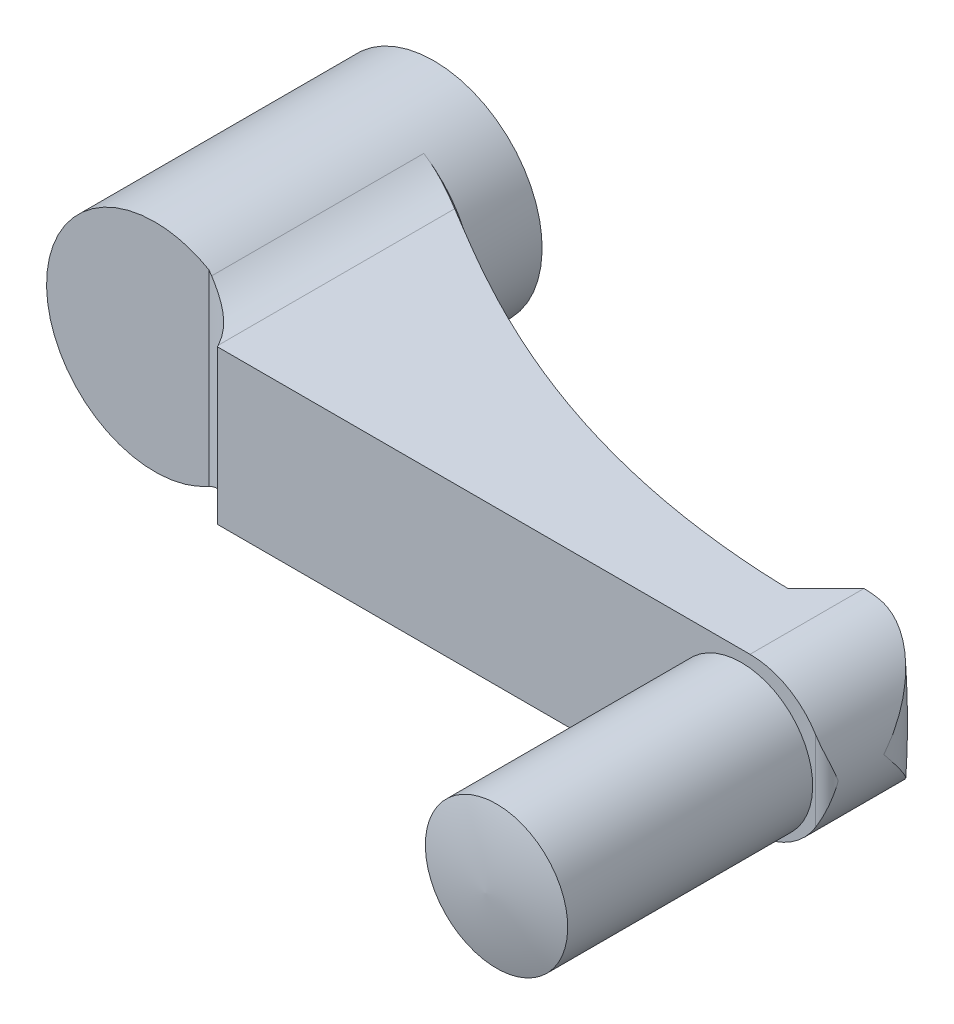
ISO-10303-21;
HEADER;
FILE_DESCRIPTION(('STEP AP214'),'2;1');
FILE_NAME('part.step','',(''),(''),'','','');
FILE_SCHEMA(('AUTOMOTIVE_DESIGN { 1 0 10303 214 1 1 1 1 }'));
ENDSEC;
DATA;
#1=APPLICATION_CONTEXT('core data for automotive mechanical design processes');
#2=APPLICATION_PROTOCOL_DEFINITION('international standard','automotive_design',2000,#1);
#3=PRODUCT_CONTEXT('',#1,'mechanical');
#4=PRODUCT('Part','Part','',(#3));
#5=PRODUCT_RELATED_PRODUCT_CATEGORY('part','',(#4));
#6=PRODUCT_DEFINITION_FORMATION('','',#4);
#7=PRODUCT_DEFINITION_CONTEXT('part definition',#1,'design');
#8=PRODUCT_DEFINITION('design','',#6,#7);
#9=PRODUCT_DEFINITION_SHAPE('','',#8);
#10=(LENGTH_UNIT() NAMED_UNIT(*) SI_UNIT(.MILLI.,.METRE.));
#11=(NAMED_UNIT(*) PLANE_ANGLE_UNIT() SI_UNIT($,.RADIAN.));
#12=(NAMED_UNIT(*) SI_UNIT($,.STERADIAN.) SOLID_ANGLE_UNIT());
#13=UNCERTAINTY_MEASURE_WITH_UNIT(LENGTH_MEASURE(1.E-05),#10,'distance_accuracy_value','');
#14=(GEOMETRIC_REPRESENTATION_CONTEXT(3) GLOBAL_UNCERTAINTY_ASSIGNED_CONTEXT((#13)) GLOBAL_UNIT_ASSIGNED_CONTEXT((#10,
#11,#12)) REPRESENTATION_CONTEXT('',''));
#15=CARTESIAN_POINT('',(0.,0.,0.));
#16=DIRECTION('',(0.,0.,1.));
#17=DIRECTION('',(1.,0.,0.));
#18=AXIS2_PLACEMENT_3D('',#15,#16,#17);
#19=CARTESIAN_POINT('',(9.5,0.,0.));
#20=DIRECTION('',(0.,0.,1.));
#21=DIRECTION('',(0.,-1.,0.));
#22=AXIS2_PLACEMENT_3D('',#19,#20,#21);
#23=PLANE('',#22);
#24=CARTESIAN_POINT('',(0.,0.,0.));
#25=DIRECTION('',(0.,0.,-1.));
#26=DIRECTION('',(0.,1.,0.));
#27=AXIS2_PLACEMENT_3D('',#24,#25,#26);
#28=CIRCLE('',#27,9.5);
#29=CARTESIAN_POINT('',(0.,9.5,0.));
#30=VERTEX_POINT('',#29);
#31=EDGE_CURVE('E360',#30,#30,#28,.T.);
#32=ORIENTED_EDGE('',*,*,#31,.T.);
#33=EDGE_LOOP('',(#32));
#34=FACE_BOUND('',#33,.T.);
#35=CARTESIAN_POINT('',(0.,0.,0.));
#36=DIRECTION('',(0.,0.,-1.));
#37=DIRECTION('',(0.,1.,0.));
#38=AXIS2_PLACEMENT_3D('',#35,#36,#37);
#39=CIRCLE('',#38,4.);
#40=CARTESIAN_POINT('',(0.,4.,0.));
#41=VERTEX_POINT('',#40);
#42=EDGE_CURVE('E605',#41,#41,#39,.T.);
#43=ORIENTED_EDGE('',*,*,#42,.F.);
#44=EDGE_LOOP('',(#43));
#45=FACE_BOUND('',#44,.T.);
#46=ADVANCED_FACE('F14',(#34,#45),#23,.F.);
#47=CARTESIAN_POINT('',(0.,0.,28.5));
#48=DIRECTION('',(0.,0.,1.));
#49=DIRECTION('',(0.,-1.,0.));
#50=AXIS2_PLACEMENT_3D('',#47,#48,#49);
#51=PLANE('',#50);
#52=DIRECTION('',(1.,0.,0.));
#53=VECTOR('',#52,1.);
#54=CARTESIAN_POINT('',(9.41740410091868,6.75,28.5));
#55=LINE('',#54,#53);
#56=CARTESIAN_POINT('',(9.5,6.75,28.5));
#57=VERTEX_POINT('',#56);
#58=CARTESIAN_POINT('',(56.25,6.75,28.5));
#59=VERTEX_POINT('',#58);
#60=EDGE_CURVE('E376',#57,#59,#55,.T.);
#61=ORIENTED_EDGE('',*,*,#60,.F.);
#62=DIRECTION('',(0.,1.,0.));
#63=VECTOR('',#62,1.);
#64=CARTESIAN_POINT('',(9.5,-13.5,28.5));
#65=LINE('',#64,#63);
#66=CARTESIAN_POINT('',(9.5,-6.75,28.5));
#67=VERTEX_POINT('',#66);
#68=EDGE_CURVE('E392',#67,#57,#65,.T.);
#69=ORIENTED_EDGE('',*,*,#68,.F.);
#70=DIRECTION('',(-1.,0.,0.));
#71=VECTOR('',#70,1.);
#72=CARTESIAN_POINT('',(56.25,-6.75,28.5));
#73=LINE('',#72,#71);
#74=CARTESIAN_POINT('',(56.25,-6.75,28.5));
#75=VERTEX_POINT('',#74);
#76=EDGE_CURVE('E374',#75,#67,#73,.T.);
#77=ORIENTED_EDGE('',*,*,#76,.F.);
#78=CARTESIAN_POINT('',(56.25,0.,28.5));
#79=DIRECTION('',(0.,0.,1.));
#80=DIRECTION('',(0.,-1.,0.));
#81=AXIS2_PLACEMENT_3D('',#78,#79,#80);
#82=CIRCLE('',#81,6.75);
#83=CARTESIAN_POINT('',(62.,-3.53553390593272,28.5));
#84=VERTEX_POINT('',#83);
#85=EDGE_CURVE('E347',#75,#84,#82,.T.);
#86=ORIENTED_EDGE('',*,*,#85,.T.);
#87=DIRECTION('',(0.,1.,0.));
#88=VECTOR('',#87,1.);
#89=CARTESIAN_POINT('',(62.,-13.5,28.5));
#90=LINE('',#89,#88);
#91=CARTESIAN_POINT('',(62.,3.53553390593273,28.5));
#92=VERTEX_POINT('',#91);
#93=EDGE_CURVE('E341',#84,#92,#90,.T.);
#94=ORIENTED_EDGE('',*,*,#93,.T.);
#95=EDGE_CURVE('E352',#92,#59,#82,.T.);
#96=ORIENTED_EDGE('',*,*,#95,.T.);
#97=EDGE_LOOP('',(#61,#69,#77,#86,#94,#96));
#98=FACE_BOUND('',#97,.T.);
#99=CARTESIAN_POINT('',(56.,0.,28.5));
#100=DIRECTION('',(0.,0.,-1.));
#101=DIRECTION('',(0.,1.,0.));
#102=AXIS2_PLACEMENT_3D('',#99,#100,#101);
#103=CIRCLE('',#102,3.375);
#104=CARTESIAN_POINT('',(56.,3.375,28.5));
#105=VERTEX_POINT('',#104);
#106=EDGE_CURVE('E609',#105,#105,#103,.T.);
#107=ORIENTED_EDGE('',*,*,#106,.T.);
#108=EDGE_LOOP('',(#107));
#109=FACE_BOUND('',#108,.T.);
#110=ADVANCED_FACE('F172',(#98,#109),#51,.T.);
#111=CARTESIAN_POINT('',(56.25,0.,0.));
#112=DIRECTION('',(0.,0.,1.));
#113=DIRECTION('',(0.,-1.,0.));
#114=AXIS2_PLACEMENT_3D('',#111,#112,#113);
#115=CYLINDRICAL_SURFACE('',#114,6.75);
#116=CARTESIAN_POINT('',(56.25,0.,18.5));
#117=DIRECTION('',(0.,0.,-1.));
#118=DIRECTION('',(0.,1.,0.));
#119=AXIS2_PLACEMENT_3D('',#116,#117,#118);
#120=CIRCLE('',#119,6.75);
#121=CARTESIAN_POINT('',(56.25,-6.75,18.5));
#122=VERTEX_POINT('',#121);
#123=CARTESIAN_POINT('',(57.6222222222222,-6.60904729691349,18.5));
#124=VERTEX_POINT('',#123);
#125=EDGE_CURVE('E28',#122,#124,#120,.F.);
#126=ORIENTED_EDGE('',*,*,#125,.T.);
#127=CARTESIAN_POINT('',(63.0000000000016,0.,23.5));
#128=CARTESIAN_POINT('',(63.000000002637,-0.0044970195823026,23.4963428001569));
#129=CARTESIAN_POINT('',(62.9999955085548,-0.00899415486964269,23.4926855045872));
#130=CARTESIAN_POINT('',(62.9990290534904,-0.492389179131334,23.0995643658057));
#131=CARTESIAN_POINT('',(62.9470747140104,-0.972519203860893,22.7090875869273));
#132=CARTESIAN_POINT('',(62.7914241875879,-1.68267725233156,22.1327302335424));
#133=CARTESIAN_POINT('',(62.7263992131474,-1.9181402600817,21.9418342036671));
#134=CARTESIAN_POINT('',(62.5697388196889,-2.38405122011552,21.5648097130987));
#135=CARTESIAN_POINT('',(62.4781161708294,-2.61450152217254,21.3786790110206));
#136=CARTESIAN_POINT('',(62.2936525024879,-3.01200141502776,21.058607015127));
#137=CARTESIAN_POINT('',(62.2067405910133,-3.18060971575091,20.9231634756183));
#138=CARTESIAN_POINT('',(62.0171292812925,-3.51273587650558,20.6572667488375));
#139=CARTESIAN_POINT('',(61.9144298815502,-3.67625373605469,20.5268135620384));
#140=CARTESIAN_POINT('',(61.5823592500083,-4.15689229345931,20.1451977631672));
#141=CARTESIAN_POINT('',(61.3285675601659,-4.4650870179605,19.9029793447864));
#142=CARTESIAN_POINT('',(60.8279801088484,-4.9695365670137,19.514578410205));
#143=CARTESIAN_POINT('',(60.5962733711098,-5.17415699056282,19.359741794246));
#144=CARTESIAN_POINT('',(60.0956691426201,-5.55627070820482,19.0792036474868));
#145=CARTESIAN_POINT('',(59.8268234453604,-5.73380106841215,18.953462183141));
#146=CARTESIAN_POINT('',(59.3147103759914,-6.01970396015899,18.7639560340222));
#147=CARTESIAN_POINT('',(59.0780207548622,-6.13476460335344,18.692711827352));
#148=CARTESIAN_POINT('',(58.7095290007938,-6.28736610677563,18.6089864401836));
#149=CARTESIAN_POINT('',(58.5843981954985,-6.3349180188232,18.5849293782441));
#150=CARTESIAN_POINT('',(58.3302912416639,-6.42284499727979,18.5453137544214));
#151=CARTESIAN_POINT('',(58.2013152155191,-6.46322029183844,18.5297549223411));
#152=CARTESIAN_POINT('',(57.9391876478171,-6.53665434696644,18.5077952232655));
#153=CARTESIAN_POINT('',(57.8060080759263,-6.56963994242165,18.5014827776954));
#154=CARTESIAN_POINT('',(57.5377957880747,-6.62743471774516,18.498981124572));
#155=CARTESIAN_POINT('',(57.4027633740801,-6.65224521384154,18.502790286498));
#156=CARTESIAN_POINT('',(57.1324745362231,-6.69345846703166,18.5210333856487));
#157=CARTESIAN_POINT('',(56.9972194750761,-6.70988170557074,18.5354412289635));
#158=CARTESIAN_POINT('',(56.7276398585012,-6.7344375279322,18.575167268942));
#159=CARTESIAN_POINT('',(56.5933145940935,-6.74257733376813,18.600475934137));
#160=CARTESIAN_POINT('',(56.4249365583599,-6.74782542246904,18.6394103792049));
#161=CARTESIAN_POINT('',(56.3897555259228,-6.74864448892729,18.6479490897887));
#162=CARTESIAN_POINT('',(56.3196160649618,-6.74973184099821,18.6657846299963));
#163=CARTESIAN_POINT('',(56.284657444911,-6.75000069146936,18.6750806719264));
#164=CARTESIAN_POINT('',(56.2498,-6.74999999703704,18.684759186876));
#165=B_SPLINE_CURVE_WITH_KNOTS('',3,(#127,#128,#129,#130,#131,#132,#133,#134,#135,#136,#137,
#138,#139,#140,#141,#142,#143,#144,#145,#146,#147,#148,#149,#150,#151,#152,#153,#154,#155,#156,
#157,#158,#159,#160,#161,#162,#163,#164),.UNSPECIFIED.,.F.,.F.,(4,2,2,2,2,2,2,2,2,2,2,2,2,2,2,2,
2,2,4),(0.,0.017389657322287,1.86916118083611,2.79841253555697,3.72721847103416,
4.42584395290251,5.12446950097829,6.51771484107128,7.55149632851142,8.58385040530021,
9.39831318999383,9.80589914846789,10.2134721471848,10.624917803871,11.0362971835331,
11.4466671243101,11.8566789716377,11.9653061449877,12.0738217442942),.UNSPECIFIED.);
#166=CARTESIAN_POINT('',(63.,0.,23.5));
#167=VERTEX_POINT('',#166);
#168=EDGE_CURVE('E149',#124,#167,#165,.F.);
#169=ORIENTED_EDGE('',*,*,#168,.T.);
#170=CARTESIAN_POINT('',(63.0000000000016,0.,23.5));
#171=CARTESIAN_POINT('',(63.000000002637,0.00449701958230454,23.4963428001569));
#172=CARTESIAN_POINT('',(62.9999955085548,0.00899415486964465,23.4926855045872));
#173=CARTESIAN_POINT('',(62.9990290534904,0.492389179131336,23.0995643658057));
#174=CARTESIAN_POINT('',(62.9470747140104,0.972519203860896,22.7090875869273));
#175=CARTESIAN_POINT('',(62.7914241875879,1.68267725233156,22.1327302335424));
#176=CARTESIAN_POINT('',(62.7263992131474,1.9181402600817,21.9418342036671));
#177=CARTESIAN_POINT('',(62.5697388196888,2.38405122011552,21.5648097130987));
#178=CARTESIAN_POINT('',(62.4781161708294,2.61450152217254,21.3786790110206));
#179=CARTESIAN_POINT('',(62.2936525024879,3.01200141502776,21.058607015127));
#180=CARTESIAN_POINT('',(62.2067405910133,3.18060971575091,20.9231634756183));
#181=CARTESIAN_POINT('',(62.0171292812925,3.51273587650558,20.6572667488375));
#182=CARTESIAN_POINT('',(61.9144298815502,3.67625373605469,20.5268135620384));
#183=CARTESIAN_POINT('',(61.5823592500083,4.15689229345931,20.1451977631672));
#184=CARTESIAN_POINT('',(61.3285675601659,4.46508701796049,19.9029793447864));
#185=CARTESIAN_POINT('',(60.8279801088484,4.9695365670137,19.514578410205));
#186=CARTESIAN_POINT('',(60.5962733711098,5.17415699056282,19.359741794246));
#187=CARTESIAN_POINT('',(60.0956691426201,5.55627070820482,19.0792036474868));
#188=CARTESIAN_POINT('',(59.8268234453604,5.73380106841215,18.953462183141));
#189=CARTESIAN_POINT('',(59.3147103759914,6.01970396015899,18.7639560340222));
#190=CARTESIAN_POINT('',(59.0780207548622,6.13476460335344,18.692711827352));
#191=CARTESIAN_POINT('',(58.7095290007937,6.28736610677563,18.6089864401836));
#192=CARTESIAN_POINT('',(58.5843981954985,6.3349180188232,18.5849293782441));
#193=CARTESIAN_POINT('',(58.3302912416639,6.4228449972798,18.5453137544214));
#194=CARTESIAN_POINT('',(58.2013152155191,6.46322029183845,18.5297549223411));
#195=CARTESIAN_POINT('',(57.9391876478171,6.53665434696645,18.5077952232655));
#196=CARTESIAN_POINT('',(57.8060080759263,6.56963994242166,18.5014827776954));
#197=CARTESIAN_POINT('',(57.5377957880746,6.62743471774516,18.498981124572));
#198=CARTESIAN_POINT('',(57.4027633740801,6.65224521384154,18.502790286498));
#199=CARTESIAN_POINT('',(57.1324745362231,6.69345846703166,18.5210333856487));
#200=CARTESIAN_POINT('',(56.9972194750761,6.70988170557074,18.5354412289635));
#201=CARTESIAN_POINT('',(56.7276398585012,6.7344375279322,18.575167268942));
#202=CARTESIAN_POINT('',(56.5933145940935,6.74257733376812,18.600475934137));
#203=CARTESIAN_POINT('',(56.4249365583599,6.74782542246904,18.6394103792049));
#204=CARTESIAN_POINT('',(56.3897555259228,6.7486444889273,18.6479490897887));
#205=CARTESIAN_POINT('',(56.3196160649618,6.74973184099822,18.6657846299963));
#206=CARTESIAN_POINT('',(56.284657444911,6.75000069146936,18.6750806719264));
#207=CARTESIAN_POINT('',(56.2498,6.74999999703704,18.684759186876));
#208=B_SPLINE_CURVE_WITH_KNOTS('',3,(#170,#171,#172,#173,#174,#175,#176,#177,#178,#179,#180,
#181,#182,#183,#184,#185,#186,#187,#188,#189,#190,#191,#192,#193,#194,#195,#196,#197,#198,#199,
#200,#201,#202,#203,#204,#205,#206,#207),.UNSPECIFIED.,.F.,.F.,(4,2,2,2,2,2,2,2,2,2,2,2,2,2,2,2,
2,2,4),(0.,0.017389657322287,1.86916118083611,2.79841253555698,3.72721847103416,4.4258439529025,
5.12446950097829,6.51771484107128,7.55149632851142,8.58385040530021,9.39831318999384,
9.80589914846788,10.2134721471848,10.624917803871,11.0362971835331,11.4466671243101,
11.8566789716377,11.9653061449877,12.0738217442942),.UNSPECIFIED.);
#209=CARTESIAN_POINT('',(57.6222222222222,6.60904729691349,18.5));
#210=VERTEX_POINT('',#209);
#211=EDGE_CURVE('E157',#167,#210,#208,.T.);
#212=ORIENTED_EDGE('',*,*,#211,.T.);
#213=CARTESIAN_POINT('',(56.25,6.75,18.5));
#214=VERTEX_POINT('',#213);
#215=EDGE_CURVE('E189',#210,#214,#120,.F.);
#216=ORIENTED_EDGE('',*,*,#215,.T.);
#217=DIRECTION('',(0.,0.,1.));
#218=VECTOR('',#217,1.);
#219=CARTESIAN_POINT('',(56.25,6.75,0.));
#220=LINE('',#219,#218);
#221=EDGE_CURVE('E367',#214,#59,#220,.T.);
#222=ORIENTED_EDGE('',*,*,#221,.T.);
#223=ORIENTED_EDGE('',*,*,#95,.F.);
#224=CARTESIAN_POINT('',(62.,3.53553390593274,28.5));
#225=CARTESIAN_POINT('',(62.0299932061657,3.48675666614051,28.4999933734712));
#226=CARTESIAN_POINT('',(62.0593538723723,3.43761273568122,28.4986515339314));
#227=CARTESIAN_POINT('',(62.1167538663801,3.33870692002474,28.4935798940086));
#228=CARTESIAN_POINT('',(62.1447937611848,3.28894531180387,28.489851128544));
#229=CARTESIAN_POINT('',(62.2267562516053,3.13908056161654,28.4755285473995));
#230=CARTESIAN_POINT('',(62.2786643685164,3.03816514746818,28.4617957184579));
#231=CARTESIAN_POINT('',(62.3766467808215,2.83536966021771,28.4277987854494));
#232=CARTESIAN_POINT('',(62.4227515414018,2.73349792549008,28.4075709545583));
#233=CARTESIAN_POINT('',(62.5095025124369,2.52854152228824,28.3618646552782));
#234=CARTESIAN_POINT('',(62.550144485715,2.42545597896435,28.3363821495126));
#235=CARTESIAN_POINT('',(62.6493297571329,2.15471359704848,28.2642737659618));
#236=CARTESIAN_POINT('',(62.7035065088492,1.9863427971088,28.2142841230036));
#237=CARTESIAN_POINT('',(62.7980553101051,1.64812969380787,28.1068184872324));
#238=CARTESIAN_POINT('',(62.8384218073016,1.47828682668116,28.0493394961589));
#239=CARTESIAN_POINT('',(62.9057483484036,1.13742664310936,27.9293690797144));
#240=CARTESIAN_POINT('',(62.932686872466,0.966407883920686,27.8668697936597));
#241=CARTESIAN_POINT('',(62.9733111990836,0.623942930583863,27.739076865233));
#242=CARTESIAN_POINT('',(62.9870036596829,0.452496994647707,27.6737846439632));
#243=CARTESIAN_POINT('',(62.997837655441,0.192449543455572,27.5740662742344));
#244=CARTESIAN_POINT('',(62.999781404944,0.10389110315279,27.5399873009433));
#245=CARTESIAN_POINT('',(62.9999941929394,0.0102233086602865,27.5039349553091));
#246=CARTESIAN_POINT('',(62.9999999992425,0.0051116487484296,27.5019674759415));
#247=CARTESIAN_POINT('',(63.,0.,27.5));
#248=B_SPLINE_CURVE_WITH_KNOTS('',3,(#224,#225,#226,#227,#228,#229,#230,#231,#232,#233,#234,
#235,#236,#237,#238,#239,#240,#241,#242,#243,#244,#245,#246,#247),.UNSPECIFIED.,.F.,.F.,(4,2,2,
2,2,2,2,2,2,2,2,4),(0.,0.171732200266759,0.343389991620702,0.685890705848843,1.026510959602,
1.36739390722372,1.91796289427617,2.46875297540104,3.02042294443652,3.57181547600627,
3.85648313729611,3.87291482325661),.UNSPECIFIED.);
#249=CARTESIAN_POINT('',(63.,0.,27.5));
#250=VERTEX_POINT('',#249);
#251=EDGE_CURVE('E183',#250,#92,#248,.F.);
#252=ORIENTED_EDGE('',*,*,#251,.F.);
#253=CARTESIAN_POINT('',(62.,-3.53553390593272,28.5));
#254=CARTESIAN_POINT('',(62.0299932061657,-3.4867566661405,28.4999933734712));
#255=CARTESIAN_POINT('',(62.0593538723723,-3.43761273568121,28.4986515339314));
#256=CARTESIAN_POINT('',(62.1167538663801,-3.33870692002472,28.4935798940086));
#257=CARTESIAN_POINT('',(62.1447937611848,-3.28894531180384,28.489851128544));
#258=CARTESIAN_POINT('',(62.2267562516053,-3.13908056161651,28.4755285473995));
#259=CARTESIAN_POINT('',(62.2786643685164,-3.03816514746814,28.4617957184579));
#260=CARTESIAN_POINT('',(62.3766467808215,-2.83536966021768,28.4277987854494));
#261=CARTESIAN_POINT('',(62.4227515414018,-2.73349792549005,28.4075709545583));
#262=CARTESIAN_POINT('',(62.5095025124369,-2.52854152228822,28.3618646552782));
#263=CARTESIAN_POINT('',(62.550144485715,-2.42545597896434,28.3363821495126));
#264=CARTESIAN_POINT('',(62.6493297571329,-2.15471359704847,28.2642737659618));
#265=CARTESIAN_POINT('',(62.7035065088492,-1.98634279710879,28.2142841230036));
#266=CARTESIAN_POINT('',(62.7980553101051,-1.64812969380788,28.1068184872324));
#267=CARTESIAN_POINT('',(62.8384218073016,-1.47828682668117,28.0493394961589));
#268=CARTESIAN_POINT('',(62.9057483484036,-1.13742664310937,27.9293690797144));
#269=CARTESIAN_POINT('',(62.932686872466,-0.966407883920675,27.8668697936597));
#270=CARTESIAN_POINT('',(62.9733111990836,-0.623942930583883,27.739076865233));
#271=CARTESIAN_POINT('',(62.9870036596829,-0.452496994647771,27.673784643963));
#272=CARTESIAN_POINT('',(62.997837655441,-0.192449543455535,27.5740662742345));
#273=CARTESIAN_POINT('',(62.999781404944,-0.103891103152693,27.5399873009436));
#274=CARTESIAN_POINT('',(62.9999941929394,-0.010223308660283,27.5039349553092));
#275=CARTESIAN_POINT('',(62.9999999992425,-0.0051116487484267,27.5019674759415));
#276=CARTESIAN_POINT('',(63.,0.,27.5));
#277=B_SPLINE_CURVE_WITH_KNOTS('',3,(#253,#254,#255,#256,#257,#258,#259,#260,#261,#262,#263,
#264,#265,#266,#267,#268,#269,#270,#271,#272,#273,#274,#275,#276),.UNSPECIFIED.,.F.,.F.,(4,2,2,
2,2,2,2,2,2,2,2,4),(0.,0.171732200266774,0.34338999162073,0.685890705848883,1.02651095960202,
1.36739390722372,1.91796289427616,2.46875297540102,3.02042294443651,3.57181547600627,
3.85648313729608,3.8729148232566),.UNSPECIFIED.);
#278=EDGE_CURVE('E9',#84,#250,#277,.T.);
#279=ORIENTED_EDGE('',*,*,#278,.F.);
#280=ORIENTED_EDGE('',*,*,#85,.F.);
#281=DIRECTION('',(0.,0.,1.));
#282=VECTOR('',#281,1.);
#283=CARTESIAN_POINT('',(56.25,-6.75,0.));
#284=LINE('',#283,#282);
#285=EDGE_CURVE('E332',#122,#75,#284,.T.);
#286=ORIENTED_EDGE('',*,*,#285,.F.);
#287=EDGE_LOOP('',(#126,#169,#212,#216,#222,#223,#252,#279,#280,#286));
#288=FACE_BOUND('',#287,.T.);
#289=ADVANCED_FACE('F166',(#288),#115,.T.);
#290=CARTESIAN_POINT('',(55.1135044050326,-13.5,-51.6338287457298));
#291=DIRECTION('',(0.,1.,0.));
#292=DIRECTION('',(-1.,0.,0.));
#293=AXIS2_PLACEMENT_3D('',#290,#291,#292);
#294=CYLINDRICAL_SURFACE('',#293,73.5);
#295=CARTESIAN_POINT('',(55.1135044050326,-6.75,-51.6338287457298));
#296=DIRECTION('',(0.,1.,0.));
#297=DIRECTION('',(-1.,0.,0.));
#298=AXIS2_PLACEMENT_3D('',#295,#296,#297);
#299=CIRCLE('',#298,73.5);
#300=CARTESIAN_POINT('',(52.9166666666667,-6.75,21.8333333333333));
#301=VERTEX_POINT('',#300);
#302=CARTESIAN_POINT('',(52.4982079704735,-6.75,21.8196274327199));
#303=VERTEX_POINT('',#302);
#304=EDGE_CURVE('E329',#301,#303,#299,.F.);
#305=ORIENTED_EDGE('',*,*,#304,.T.);
#306=CARTESIAN_POINT('',(52.3137730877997,-8.1002,21.8128287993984));
#307=CARTESIAN_POINT('',(52.4139674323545,-7.42828007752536,21.8166351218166));
#308=CARTESIAN_POINT('',(52.5018581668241,-6.75451380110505,21.819792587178));
#309=CARTESIAN_POINT('',(52.652738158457,-5.40418281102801,21.8250089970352));
#310=CARTESIAN_POINT('',(52.7157269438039,-4.72761804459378,21.8270679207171));
#311=CARTESIAN_POINT('',(52.8162280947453,-3.37633247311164,21.8302774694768));
#312=CARTESIAN_POINT('',(52.853878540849,-2.70162196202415,21.8314330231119));
#313=CARTESIAN_POINT('',(52.9040976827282,-1.35127429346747,21.8329609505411));
#314=CARTESIAN_POINT('',(52.916666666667,-0.675637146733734,21.8333333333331));
#315=CARTESIAN_POINT('',(52.916666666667,0.675637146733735,21.8333333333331));
#316=CARTESIAN_POINT('',(52.9040976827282,1.35127429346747,21.8329609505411));
#317=CARTESIAN_POINT('',(52.853878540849,2.70162196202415,21.8314330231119));
#318=CARTESIAN_POINT('',(52.8162280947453,3.37633247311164,21.8302774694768));
#319=CARTESIAN_POINT('',(52.7157269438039,4.72761804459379,21.8270679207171));
#320=CARTESIAN_POINT('',(52.652738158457,5.40418281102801,21.8250089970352));
#321=CARTESIAN_POINT('',(52.5018581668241,6.75451380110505,21.819792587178));
#322=CARTESIAN_POINT('',(52.4139674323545,7.42828007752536,21.8166351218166));
#323=CARTESIAN_POINT('',(52.3137730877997,8.1002,21.8128287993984));
#324=B_SPLINE_CURVE_WITH_KNOTS('',3,(#306,#307,#308,#309,#310,#311,#312,#313,#314,#315,#316,
#317,#318,#319,#320,#321,#322,#323),.UNSPECIFIED.,.F.,.F.,(4,2,2,2,2,2,2,2,4),(0.,
2.03797753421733,4.07599368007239,6.10281178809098,8.12960660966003,10.1564014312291,
12.1832195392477,14.2212356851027,16.25921321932),.UNSPECIFIED.);
#325=CARTESIAN_POINT('',(52.9166666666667,0.,21.8333333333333));
#326=VERTEX_POINT('',#325);
#327=EDGE_CURVE('E299',#303,#326,#324,.T.);
#328=ORIENTED_EDGE('',*,*,#327,.T.);
#329=DIRECTION('',(0.,1.,0.));
#330=VECTOR('',#329,1.);
#331=CARTESIAN_POINT('',(52.9166666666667,-13.5,21.8333333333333));
#332=LINE('',#331,#330);
#333=EDGE_CURVE('E265',#301,#326,#332,.T.);
#334=ORIENTED_EDGE('',*,*,#333,.F.);
#335=EDGE_LOOP('',(#305,#328,#334));
#336=FACE_BOUND('',#335,.T.);
#337=ADVANCED_FACE('F171',(#336),#294,.F.);
#338=CARTESIAN_POINT('',(52.9166666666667,6.75,21.8333333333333));
#339=VERTEX_POINT('',#338);
#340=EDGE_CURVE('E259',#326,#339,#332,.T.);
#341=ORIENTED_EDGE('',*,*,#340,.F.);
#342=CARTESIAN_POINT('',(52.4982079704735,6.75,21.8196274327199));
#343=VERTEX_POINT('',#342);
#344=EDGE_CURVE('E303',#326,#343,#324,.T.);
#345=ORIENTED_EDGE('',*,*,#344,.T.);
#346=CARTESIAN_POINT('',(55.1135044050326,6.75,-51.6338287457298));
#347=DIRECTION('',(0.,-1.,0.));
#348=DIRECTION('',(1.,0.,0.));
#349=AXIS2_PLACEMENT_3D('',#346,#347,#348);
#350=CIRCLE('',#349,73.5);
#351=EDGE_CURVE('E379',#343,#339,#350,.F.);
#352=ORIENTED_EDGE('',*,*,#351,.T.);
#353=EDGE_LOOP('',(#341,#345,#352));
#354=FACE_BOUND('',#353,.T.);
#355=ADVANCED_FACE('F406',(#354),#294,.F.);
#356=CARTESIAN_POINT('',(58.,-13.5,18.5));
#357=DIRECTION('',(0.,0.,-1.));
#358=DIRECTION('',(0.,1.,0.));
#359=AXIS2_PLACEMENT_3D('',#356,#357,#358);
#360=PLANE('',#359);
#361=ORIENTED_EDGE('',*,*,#215,.F.);
#362=CARTESIAN_POINT('',(0.,0.,18.5));
#363=DIRECTION('',(0.,0.,-1.));
#364=DIRECTION('',(0.,1.,0.));
#365=AXIS2_PLACEMENT_3D('',#362,#363,#364);
#366=CIRCLE('',#365,58.);
#367=EDGE_CURVE('E43',#210,#124,#366,.T.);
#368=ORIENTED_EDGE('',*,*,#367,.T.);
#369=ORIENTED_EDGE('',*,*,#125,.F.);
#370=DIRECTION('',(0.,1.,0.));
#371=VECTOR('',#370,1.);
#372=CARTESIAN_POINT('',(56.25,-13.5,18.5));
#373=LINE('',#372,#371);
#374=EDGE_CURVE('E327',#122,#214,#373,.T.);
#375=ORIENTED_EDGE('',*,*,#374,.T.);
#376=EDGE_LOOP('',(#361,#368,#369,#375));
#377=FACE_BOUND('',#376,.T.);
#378=ADVANCED_FACE('F198',(#377),#360,.T.);
#379=CARTESIAN_POINT('',(0.,0.,0.));
#380=DIRECTION('',(0.,0.,-1.));
#381=DIRECTION('',(0.,1.,0.));
#382=AXIS2_PLACEMENT_3D('',#379,#380,#381);
#383=CYLINDRICAL_SURFACE('',#382,9.5);
#384=CARTESIAN_POINT('',(0.,0.,6.));
#385=DIRECTION('',(0.,0.,-1.));
#386=DIRECTION('',(0.,1.,0.));
#387=AXIS2_PLACEMENT_3D('',#384,#385,#386);
#388=CIRCLE('',#387,9.5);
#389=CARTESIAN_POINT('',(5.11230508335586,8.00714285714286,6.));
#390=VERTEX_POINT('',#389);
#391=CARTESIAN_POINT('',(5.11230508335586,-8.00714285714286,6.));
#392=VERTEX_POINT('',#391);
#393=EDGE_CURVE('E147',#390,#392,#388,.T.);
#394=ORIENTED_EDGE('',*,*,#393,.T.);
#395=DIRECTION('',(0.,0.,1.));
#396=VECTOR('',#395,1.);
#397=CARTESIAN_POINT('',(5.11230508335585,-8.00714285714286,0.));
#398=LINE('',#397,#396);
#399=CARTESIAN_POINT('',(5.11230508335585,-8.00714285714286,24.6221602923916));
#400=VERTEX_POINT('',#399);
#401=EDGE_CURVE('E372',#392,#400,#398,.T.);
#402=ORIENTED_EDGE('',*,*,#401,.T.);
#403=CARTESIAN_POINT('',(4.75,-8.22724133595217,24.5));
#404=CARTESIAN_POINT('',(4.81150545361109,-8.19172178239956,24.5191309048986));
#405=CARTESIAN_POINT('',(4.87245027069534,-8.15562046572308,24.5388763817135));
#406=CARTESIAN_POINT('',(4.99321863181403,-8.08225430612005,24.5795964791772));
#407=CARTESIAN_POINT('',(5.05304217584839,-8.04498946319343,24.6005710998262));
#408=CARTESIAN_POINT('',(5.11230508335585,-8.00714285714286,24.6221602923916));
#409=B_SPLINE_CURVE_WITH_KNOTS('',3,(#403,#404,#405,#406,#407,#408),.UNSPECIFIED.,.F.,.F.,(4,2,
4),(0.,0.22060629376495,0.441212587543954),.UNSPECIFIED.);
#410=CARTESIAN_POINT('',(4.75,-8.22724133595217,24.5));
#411=VERTEX_POINT('',#410);
#412=EDGE_CURVE('E220',#411,#400,#409,.T.);
#413=ORIENTED_EDGE('',*,*,#412,.F.);
#414=CARTESIAN_POINT('',(0.,0.,24.5));
#415=DIRECTION('',(0.,0.,-1.));
#416=DIRECTION('',(0.,1.,0.));
#417=AXIS2_PLACEMENT_3D('',#414,#415,#416);
#418=CIRCLE('',#417,9.5);
#419=CARTESIAN_POINT('',(4.75,8.22724133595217,24.5));
#420=VERTEX_POINT('',#419);
#421=EDGE_CURVE('E356',#411,#420,#418,.T.);
#422=ORIENTED_EDGE('',*,*,#421,.T.);
#423=CARTESIAN_POINT('',(5.11230508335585,8.00714285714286,24.6221602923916));
#424=CARTESIAN_POINT('',(5.05304217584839,8.04498946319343,24.6005710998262));
#425=CARTESIAN_POINT('',(4.99321863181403,8.08225430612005,24.5795964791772));
#426=CARTESIAN_POINT('',(4.87245027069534,8.15562046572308,24.5388763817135));
#427=CARTESIAN_POINT('',(4.81150545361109,8.19172178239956,24.5191309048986));
#428=CARTESIAN_POINT('',(4.75,8.22724133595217,24.5));
#429=B_SPLINE_CURVE_WITH_KNOTS('',3,(#423,#424,#425,#426,#427,#428),.UNSPECIFIED.,.F.,.F.,(4,2,
4),(0.,0.220606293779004,0.441212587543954),.UNSPECIFIED.);
#430=CARTESIAN_POINT('',(5.11230508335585,8.00714285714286,24.6221602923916));
#431=VERTEX_POINT('',#430);
#432=EDGE_CURVE('E234',#431,#420,#429,.T.);
#433=ORIENTED_EDGE('',*,*,#432,.F.);
#434=DIRECTION('',(0.,0.,1.));
#435=VECTOR('',#434,1.);
#436=CARTESIAN_POINT('',(5.11230508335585,8.00714285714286,0.));
#437=LINE('',#436,#435);
#438=EDGE_CURVE('E363',#390,#431,#437,.T.);
#439=ORIENTED_EDGE('',*,*,#438,.F.);
#440=EDGE_LOOP('',(#394,#402,#413,#422,#433,#439));
#441=FACE_BOUND('',#440,.T.);
#442=ORIENTED_EDGE('',*,*,#31,.F.);
#443=EDGE_LOOP('',(#442));
#444=FACE_BOUND('',#443,.T.);
#445=ADVANCED_FACE('F245',(#441,#444),#383,.T.);
#446=CARTESIAN_POINT('',(9.41740410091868,14.75,0.));
#447=DIRECTION('',(0.,0.,1.));
#448=DIRECTION('',(0.,-1.,0.));
#449=AXIS2_PLACEMENT_3D('',#446,#447,#448);
#450=CYLINDRICAL_SURFACE('',#449,8.);
#451=DIRECTION('',(0.,0.,1.));
#452=VECTOR('',#451,1.);
#453=CARTESIAN_POINT('',(9.41740410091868,6.75,0.));
#454=LINE('',#453,#452);
#455=CARTESIAN_POINT('',(9.41740410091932,6.75,7.59168285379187));
#456=VERTEX_POINT('',#455);
#457=CARTESIAN_POINT('',(9.41740410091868,6.75,28.3426650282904));
#458=VERTEX_POINT('',#457);
#459=EDGE_CURVE('E365',#456,#458,#454,.T.);
#460=ORIENTED_EDGE('',*,*,#459,.F.);
#461=CARTESIAN_POINT('',(9.41760410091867,6.7500000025,7.59180232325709));
#462=CARTESIAN_POINT('',(9.32767453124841,6.7499993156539,7.5380856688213));
#463=CARTESIAN_POINT('',(9.23744252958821,6.75151170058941,7.48488372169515));
#464=CARTESIAN_POINT('',(9.0563606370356,6.75763736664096,7.37969908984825));
#465=CARTESIAN_POINT('',(8.96551066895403,6.76225104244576,7.32771656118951));
#466=CARTESIAN_POINT('',(8.69160229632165,6.78088597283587,7.17365219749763));
#467=CARTESIAN_POINT('',(8.5076258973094,6.79970190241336,7.07371864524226));
#468=CARTESIAN_POINT('',(8.13419625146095,6.85129743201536,6.87998767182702));
#469=CARTESIAN_POINT('',(7.94470346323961,6.88431508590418,6.78632784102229));
#470=CARTESIAN_POINT('',(7.56405505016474,6.96520909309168,6.60998044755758));
#471=CARTESIAN_POINT('',(7.37290150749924,7.013068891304,6.52728080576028));
#472=CARTESIAN_POINT('',(6.9217639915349,7.14444366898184,6.34947838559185));
#473=CARTESIAN_POINT('',(6.66121836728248,7.23457870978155,6.26024395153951));
#474=CARTESIAN_POINT('',(6.27346142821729,7.39235213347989,6.15353377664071));
#475=CARTESIAN_POINT('',(6.14515681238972,7.44847305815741,6.12254801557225));
#476=CARTESIAN_POINT('',(5.89008011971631,7.56823206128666,6.07048759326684));
#477=CARTESIAN_POINT('',(5.76330716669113,7.6318655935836,6.04940697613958));
#478=CARTESIAN_POINT('',(5.54878073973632,7.74686025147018,6.02256766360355));
#479=CARTESIAN_POINT('',(5.46038486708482,7.79642048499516,6.01413745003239));
#480=CARTESIAN_POINT('',(5.28501121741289,7.89918123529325,6.00283332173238));
#481=CARTESIAN_POINT('',(5.19803856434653,7.9523923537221,5.99997636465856));
#482=CARTESIAN_POINT('',(5.11210508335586,8.00727055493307,6.00000000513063));
#483=B_SPLINE_CURVE_WITH_KNOTS('',3,(#461,#462,#463,#464,#465,#466,#467,#468,#469,#470,#471,
#472,#473,#474,#475,#476,#477,#478,#479,#480,#481,#482),.UNSPECIFIED.,.F.,.F.,(4,2,2,2,2,2,2,2,
2,2,4),(0.,0.3142297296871,0.628499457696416,1.25857808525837,1.89965713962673,2.54002368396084,
3.40562350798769,3.83546751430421,4.26505272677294,4.56991344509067,4.87570032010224),.UNSPECIFIED.);
#484=EDGE_CURVE('E250',#456,#390,#483,.T.);
#485=ORIENTED_EDGE('',*,*,#484,.T.);
#486=ORIENTED_EDGE('',*,*,#438,.T.);
#487=CARTESIAN_POINT('',(9.41740410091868,6.75,28.3426650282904));
#488=CARTESIAN_POINT('',(9.32423376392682,6.75001591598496,28.1698302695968));
#489=CARTESIAN_POINT('',(9.22464677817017,6.751628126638,28.0004191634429));
#490=CARTESIAN_POINT('',(9.01328754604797,6.75950882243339,27.669352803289));
#491=CARTESIAN_POINT('',(8.90150799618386,6.76578011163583,27.5077022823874));
#492=CARTESIAN_POINT('',(8.66599264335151,6.78448849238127,27.1925631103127));
#493=CARTESIAN_POINT('',(8.54220490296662,6.7969534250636,27.0391148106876));
#494=CARTESIAN_POINT('',(8.28410488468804,6.82961171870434,26.7422523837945));
#495=CARTESIAN_POINT('',(8.14979484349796,6.84980344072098,26.5988361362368));
#496=CARTESIAN_POINT('',(7.8710571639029,6.89958860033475,26.3222448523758));
#497=CARTESIAN_POINT('',(7.72657606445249,6.92923513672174,26.1891330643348));
#498=CARTESIAN_POINT('',(7.42973045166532,6.99936077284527,25.9350362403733));
#499=CARTESIAN_POINT('',(7.27736489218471,7.03984131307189,25.8140528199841));
#500=CARTESIAN_POINT('',(6.96729072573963,7.13271598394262,25.5855371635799));
#501=CARTESIAN_POINT('',(6.80960631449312,7.18506109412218,25.4779523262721));
#502=CARTESIAN_POINT('',(6.4905721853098,7.30268144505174,25.2763068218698));
#503=CARTESIAN_POINT('',(6.32922416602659,7.36795079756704,25.1822400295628));
#504=CARTESIAN_POINT('',(5.99107585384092,7.518308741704,25.0002582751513));
#505=CARTESIAN_POINT('',(5.81414737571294,7.60462414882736,24.9135814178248));
#506=CARTESIAN_POINT('',(5.54978995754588,7.74631380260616,24.7955152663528));
#507=CARTESIAN_POINT('',(5.46173030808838,7.79565142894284,24.7581108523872));
#508=CARTESIAN_POINT('',(5.28636145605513,7.89837097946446,24.6872205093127));
#509=CARTESIAN_POINT('',(5.19905245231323,7.95175394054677,24.6537355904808));
#510=CARTESIAN_POINT('',(5.11230508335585,8.00714285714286,24.6221602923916));
#511=B_SPLINE_CURVE_WITH_KNOTS('',3,(#487,#488,#489,#490,#491,#492,#493,#494,#495,#496,#497,
#498,#499,#500,#501,#502,#503,#504,#505,#506,#507,#508,#509,#510),.UNSPECIFIED.,.F.,.F.,(4,2,2,
2,2,2,2,2,2,2,2,4),(0.,0.588952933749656,1.17826061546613,1.77024159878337,2.36209708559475,
2.95733679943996,3.5526556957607,4.14555837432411,4.73819154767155,5.38214402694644,
5.70495519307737,6.02784938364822),.UNSPECIFIED.);
#512=EDGE_CURVE('E228',#458,#431,#511,.T.);
#513=ORIENTED_EDGE('',*,*,#512,.F.);
#514=EDGE_LOOP('',(#460,#485,#486,#513));
#515=FACE_BOUND('',#514,.T.);
#516=ADVANCED_FACE('F241',(#515),#450,.F.);
#517=CARTESIAN_POINT('',(9.41740410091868,6.75,0.));
#518=DIRECTION('',(0.,-1.,0.));
#519=DIRECTION('',(1.,0.,0.));
#520=AXIS2_PLACEMENT_3D('',#517,#518,#519);
#521=PLANE('',#520);
#522=CARTESIAN_POINT('',(7.53843545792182,6.75,64.6311804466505));
#523=CARTESIAN_POINT('',(7.73725182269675,6.75,64.4830372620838));
#524=CARTESIAN_POINT('',(7.9348373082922,6.75,64.3332570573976));
#525=CARTESIAN_POINT('',(8.32783050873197,6.75,64.030887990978));
#526=CARTESIAN_POINT('',(8.52323835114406,6.75,63.8782992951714));
#527=CARTESIAN_POINT('',(8.91214040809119,6.75,63.5707952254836));
#528=CARTESIAN_POINT('',(9.10563503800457,6.75,63.4158803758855));
#529=CARTESIAN_POINT('',(9.49099221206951,6.75,63.1040294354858));
#530=CARTESIAN_POINT('',(9.68285472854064,6.75,62.9470933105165));
#531=CARTESIAN_POINT('',(10.2560693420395,6.75,62.4738920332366));
#532=CARTESIAN_POINT('',(10.6352888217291,6.75,62.1550427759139));
#533=CARTESIAN_POINT('',(11.3893287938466,6.75,61.5121528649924));
#534=CARTESIAN_POINT('',(11.7641489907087,6.75,61.1881118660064));
#535=CARTESIAN_POINT('',(12.5100279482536,6.75,60.5362573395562));
#536=CARTESIAN_POINT('',(12.8810891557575,6.75,60.2084466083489));
#537=CARTESIAN_POINT('',(13.6203949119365,6.75,59.549686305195));
#538=CARTESIAN_POINT('',(13.9886395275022,6.75,59.2187368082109));
#539=CARTESIAN_POINT('',(14.7229167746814,6.75,58.5542484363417));
#540=CARTESIAN_POINT('',(15.0889489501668,6.75,58.2207090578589));
#541=CARTESIAN_POINT('',(15.8191271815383,6.75,57.5515698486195));
#542=CARTESIAN_POINT('',(16.1832732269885,6.75,57.2159700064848));
#543=CARTESIAN_POINT('',(17.3088331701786,6.75,56.1738096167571));
#544=CARTESIAN_POINT('',(18.067595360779,6.75,55.4643854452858));
#545=CARTESIAN_POINT('',(19.5803132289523,6.75,54.0404270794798));
#546=CARTESIAN_POINT('',(20.3342688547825,6.75,53.3258928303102));
#547=CARTESIAN_POINT('',(21.8386748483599,6.75,51.8931046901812));
#548=CARTESIAN_POINT('',(22.5891251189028,6.75,51.1748506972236));
#549=CARTESIAN_POINT('',(24.0873765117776,6.75,49.7355845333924));
#550=CARTESIAN_POINT('',(24.8351776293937,6.75,49.0145723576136));
#551=CARTESIAN_POINT('',(26.3287314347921,6.75,47.5704430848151));
#552=CARTESIAN_POINT('',(27.0744841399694,6.75,46.847326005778));
#553=CARTESIAN_POINT('',(28.5643808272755,6.75,45.3994357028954));
#554=CARTESIAN_POINT('',(29.3085248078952,6.75,44.6746624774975));
#555=CARTESIAN_POINT('',(31.5390157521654,6.75,42.4984097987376));
#556=CARTESIAN_POINT('',(33.0234498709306,6.75,41.0449700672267));
#557=CARTESIAN_POINT('',(35.9906435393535,6.75,38.1329488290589));
#558=CARTESIAN_POINT('',(37.4733991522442,6.75,36.6743633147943));
#559=CARTESIAN_POINT('',(40.4365170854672,6.75,33.7547504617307));
#560=CARTESIAN_POINT('',(41.916879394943,6.75,32.2937231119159));
#561=CARTESIAN_POINT('',(44.8758182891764,6.75,29.3699383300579));
#562=CARTESIAN_POINT('',(46.3543949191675,6.75,27.9071809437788));
#563=CARTESIAN_POINT('',(49.3102321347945,6.75,24.9803412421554));
#564=CARTESIAN_POINT('',(50.7874927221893,6.75,23.5162589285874));
#565=CARTESIAN_POINT('',(54.0922817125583,6.75,20.2386938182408));
#566=CARTESIAN_POINT('',(55.9195415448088,6.75,18.4249402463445));
#567=CARTESIAN_POINT('',(59.5729098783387,6.75,14.7962726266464));
#568=CARTESIAN_POINT('',(61.3990183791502,6.75,12.9813585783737));
#569=CARTESIAN_POINT('',(66.8760710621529,6.75,7.53527190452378));
#570=CARTESIAN_POINT('',(70.5257101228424,6.75,3.90278680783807));
#571=CARTESIAN_POINT('',(77.8168583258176,6.75,-3.3583761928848));
#572=CARTESIAN_POINT('',(81.4583709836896,6.75,-6.98705056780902));
#573=CARTESIAN_POINT('',(86.9195426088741,6.75,-12.4311268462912));
#574=CARTESIAN_POINT('',(88.73974125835,6.75,-14.2459874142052));
#575=CARTESIAN_POINT('',(92.379835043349,6.75,-17.8760126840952));
#576=CARTESIAN_POINT('',(94.199730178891,6.75,-19.6911773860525));
#577=CARTESIAN_POINT('',(96.0195018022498,6.75,-21.5064658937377));
#578=B_SPLINE_CURVE_WITH_KNOTS('',3,(#522,#523,#524,#525,#526,#527,#528,#529,#530,#531,#532,
#533,#534,#535,#536,#537,#538,#539,#540,#541,#542,#543,#544,#545,#546,#547,#548,#549,#550,#551,
#552,#553,#554,#555,#556,#557,#558,#559,#560,#561,#562,#563,#564,#565,#566,#567,#568,#569,#570,
#571,#572,#573,#574,#575,#576,#577),.UNSPECIFIED.,.F.,.F.,(4,2,2,2,2,2,2,2,2,2,2,2,2,2,2,2,2,2,
2,2,2,2,2,2,2,2,2,4),(0.,0.743799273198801,1.48755474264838,2.23114502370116,2.97474789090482,
4.46103247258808,5.94741634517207,7.43276090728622,8.91807008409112,10.4036756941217,
11.8892895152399,15.0055011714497,18.1217463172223,21.2380773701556,24.3544139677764,
27.4707240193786,30.5870369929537,36.8195453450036,43.0592795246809,49.2990419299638,
55.5386428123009,61.778235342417,69.5020435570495,77.2258549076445,92.673614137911,
108.096033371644,115.807166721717,123.518299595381),.UNSPECIFIED.);
#579=CARTESIAN_POINT('',(52.484389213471,6.75,21.8333333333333));
#580=VERTEX_POINT('',#579);
#581=EDGE_CURVE('E35',#580,#343,#578,.T.);
#582=ORIENTED_EDGE('',*,*,#581,.F.);
#583=CARTESIAN_POINT('',(29.8687526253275,6.75,17.665627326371));
#584=CARTESIAN_POINT('',(28.697869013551,6.75,17.2619968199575));
#585=CARTESIAN_POINT('',(27.5364394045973,6.75,16.830991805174));
#586=CARTESIAN_POINT('',(25.2343520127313,6.75,15.9167251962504));
#587=CARTESIAN_POINT('',(24.0936937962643,6.75,15.4334646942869));
#588=CARTESIAN_POINT('',(22.3995133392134,6.75,14.6721001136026));
#589=CARTESIAN_POINT('',(21.8376901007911,6.75,14.4122844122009));
#590=CARTESIAN_POINT('',(20.7195743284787,6.75,13.8810179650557));
#591=CARTESIAN_POINT('',(20.1632816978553,6.75,13.6095674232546));
#592=CARTESIAN_POINT('',(19.0562100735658,6.75,13.0556959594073));
#593=CARTESIAN_POINT('',(18.5054309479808,6.75,12.7732753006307));
#594=CARTESIAN_POINT('',(17.4092070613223,6.75,12.1982868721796));
#595=CARTESIAN_POINT('',(16.8637622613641,6.75,11.9057191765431));
#596=CARTESIAN_POINT('',(15.6720628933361,6.75,11.2535593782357));
#597=CARTESIAN_POINT('',(15.0268765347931,6.75,10.8920163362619));
#598=CARTESIAN_POINT('',(14.0636479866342,6.75,10.3417781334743));
#599=CARTESIAN_POINT('',(13.7433297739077,6.75,10.1570444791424));
#600=CARTESIAN_POINT('',(13.1039884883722,6.75,9.78534884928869));
#601=CARTESIAN_POINT('',(12.7849654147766,6.75,9.59838687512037));
#602=CARTESIAN_POINT('',(12.1474272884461,6.75,9.22242166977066));
#603=CARTESIAN_POINT('',(11.8289139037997,6.75,9.03341561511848));
#604=CARTESIAN_POINT('',(11.1925542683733,6.75,8.65428430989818));
#605=CARTESIAN_POINT('',(10.874708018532,6.75,8.46415905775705));
#606=CARTESIAN_POINT('',(10.2392562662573,6.75,8.08361049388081));
#607=CARTESIAN_POINT('',(9.9216507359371,6.75,7.8931872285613));
#608=CARTESIAN_POINT('',(9.28601967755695,6.75,7.51304318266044));
#609=CARTESIAN_POINT('',(8.96799415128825,6.75,7.32332239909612));
#610=CARTESIAN_POINT('',(8.42422026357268,6.75,7.00133571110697));
#611=CARTESIAN_POINT('',(8.19878135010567,6.75,6.86854826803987));
#612=CARTESIAN_POINT('',(7.74692640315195,6.75,6.60464803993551));
#613=CARTESIAN_POINT('',(7.52051038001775,6.75,6.47353523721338));
#614=CARTESIAN_POINT('',(7.06611842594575,6.75,6.21368302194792));
#615=CARTESIAN_POINT('',(6.8381415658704,6.75,6.08494522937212));
#616=CARTESIAN_POINT('',(6.38026274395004,6.75,5.83093581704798));
#617=CARTESIAN_POINT('',(6.15036081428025,6.75,5.70566413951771));
#618=CARTESIAN_POINT('',(5.68821300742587,6.75,5.45996971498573));
#619=CARTESIAN_POINT('',(5.45596923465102,6.75,5.33954302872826));
#620=CARTESIAN_POINT('',(4.98823527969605,6.75,5.10506692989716));
#621=CARTESIAN_POINT('',(4.75274477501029,6.75,4.99101815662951));
#622=CARTESIAN_POINT('',(4.27803311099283,6.75,4.7715500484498));
#623=CARTESIAN_POINT('',(4.03881597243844,6.75,4.66612208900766));
#624=CARTESIAN_POINT('',(3.55577081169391,6.75,4.466503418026));
#625=CARTESIAN_POINT('',(3.31194415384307,6.75,4.37230943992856));
#626=CARTESIAN_POINT('',(2.81356401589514,6.75,4.19652131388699));
#627=CARTESIAN_POINT('',(2.55889259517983,6.75,4.11525646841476));
#628=CARTESIAN_POINT('',(2.04408993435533,6.75,3.97209402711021));
#629=CARTESIAN_POINT('',(1.78395933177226,6.75,3.91019418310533));
#630=CARTESIAN_POINT('',(1.26123186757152,6.75,3.81038377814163));
#631=CARTESIAN_POINT('',(0.998672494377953,6.75,3.77228143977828));
#632=CARTESIAN_POINT('',(0.47104231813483,6.75,3.72246704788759));
#633=CARTESIAN_POINT('',(0.205971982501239,6.75,3.71075017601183));
#634=CARTESIAN_POINT('',(-0.325210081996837,6.75,3.7148063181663));
#635=CARTESIAN_POINT('',(-0.591320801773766,6.75,3.73070970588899));
#636=CARTESIAN_POINT('',(-1.12063536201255,6.75,3.78876815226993));
#637=CARTESIAN_POINT('',(-1.38383855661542,6.75,3.83092892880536));
#638=CARTESIAN_POINT('',(-1.90774973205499,6.75,3.93851468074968));
#639=CARTESIAN_POINT('',(-2.16841597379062,6.75,4.00413921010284));
#640=CARTESIAN_POINT('',(-2.55516879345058,6.75,4.11670604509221));
#641=CARTESIAN_POINT('',(-2.68338219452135,6.75,4.15658465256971));
#642=CARTESIAN_POINT('',(-2.93842633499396,6.75,4.24052967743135));
#643=CARTESIAN_POINT('',(-3.0652571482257,6.75,4.28459586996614));
#644=CARTESIAN_POINT('',(-3.41001239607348,6.75,4.41005274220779));
#645=CARTESIAN_POINT('',(-3.62659372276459,6.75,4.49513463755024));
#646=CARTESIAN_POINT('',(-4.05612784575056,6.75,4.67405875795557));
#647=CARTESIAN_POINT('',(-4.26907970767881,6.75,4.76790319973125));
#648=CARTESIAN_POINT('',(-4.69202648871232,6.75,4.96252891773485));
#649=CARTESIAN_POINT('',(-4.90201828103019,6.75,5.0633169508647));
#650=CARTESIAN_POINT('',(-5.31933750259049,6.75,5.27019568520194));
#651=CARTESIAN_POINT('',(-5.52666514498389,6.75,5.37628595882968));
#652=CARTESIAN_POINT('',(-5.93987463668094,6.75,5.59291487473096));
#653=CARTESIAN_POINT('',(-6.14574916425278,6.75,5.70346742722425));
#654=CARTESIAN_POINT('',(-6.55579054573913,6.75,5.92769231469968));
#655=CARTESIAN_POINT('',(-6.75995737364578,6.75,6.0413646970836));
#656=CARTESIAN_POINT('',(-7.16686886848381,6.75,6.27097467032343));
#657=CARTESIAN_POINT('',(-7.36961422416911,6.75,6.38691104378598));
#658=CARTESIAN_POINT('',(-7.77412883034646,6.75,6.62047639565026));
#659=CARTESIAN_POINT('',(-7.97589806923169,6.75,6.73810539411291));
#660=CARTESIAN_POINT('',(-8.58277860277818,6.75,7.09425251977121));
#661=CARTESIAN_POINT('',(-8.98685028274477,6.75,7.33453794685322));
#662=CARTESIAN_POINT('',(-9.79410815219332,6.75,7.81666424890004));
#663=CARTESIAN_POINT('',(-10.1972942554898,6.75,8.05850526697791));
#664=CARTESIAN_POINT('',(-11.0032577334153,6.75,8.54111568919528));
#665=CARTESIAN_POINT('',(-11.4060344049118,6.75,8.78188625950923));
#666=CARTESIAN_POINT('',(-12.2128691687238,6.75,9.26128556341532));
#667=CARTESIAN_POINT('',(-12.6169272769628,6.75,9.49991427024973));
#668=CARTESIAN_POINT('',(-13.5771293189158,6.75,10.0617297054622));
#669=CARTESIAN_POINT('',(-14.1341237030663,6.75,10.3834683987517));
#670=CARTESIAN_POINT('',(-15.25286279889,6.75,11.018598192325));
#671=CARTESIAN_POINT('',(-15.8146075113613,6.75,11.3319892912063));
#672=CARTESIAN_POINT('',(-16.943507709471,6.75,11.9488912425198));
#673=CARTESIAN_POINT('',(-17.5106632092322,6.75,12.252402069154));
#674=CARTESIAN_POINT('',(-18.6507463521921,6.75,12.8483777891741));
#675=CARTESIAN_POINT('',(-19.2236739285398,6.75,13.1408428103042));
#676=CARTESIAN_POINT('',(-20.3757799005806,6.75,13.7139777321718));
#677=CARTESIAN_POINT('',(-20.9549613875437,6.75,13.9946414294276));
#678=CARTESIAN_POINT('',(-22.1192895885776,6.75,14.543286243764));
#679=CARTESIAN_POINT('',(-22.7044363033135,6.75,14.8112673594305));
#680=CARTESIAN_POINT('',(-24.4687915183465,6.75,15.5952949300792));
#681=CARTESIAN_POINT('',(-25.6569379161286,6.75,16.0914370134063));
#682=CARTESIAN_POINT('',(-28.0542301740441,6.75,17.0263846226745));
#683=CARTESIAN_POINT('',(-29.263354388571,6.75,17.465245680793));
#684=CARTESIAN_POINT('',(-31.7015798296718,6.75,18.283534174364));
#685=CARTESIAN_POINT('',(-32.9306809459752,6.75,18.6629619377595));
#686=CARTESIAN_POINT('',(-35.4065095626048,6.75,19.3603802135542));
#687=CARTESIAN_POINT('',(-36.6532410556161,6.75,19.6783565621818));
#688=CARTESIAN_POINT('',(-39.1611403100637,6.75,20.2511497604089));
#689=CARTESIAN_POINT('',(-40.422307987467,6.75,20.5059669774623));
#690=CARTESIAN_POINT('',(-42.9033860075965,6.75,20.9419549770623));
#691=CARTESIAN_POINT('',(-44.1228369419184,6.75,21.1257428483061));
#692=CARTESIAN_POINT('',(-46.5692801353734,6.75,21.4333141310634));
#693=CARTESIAN_POINT('',(-47.7962723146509,6.75,21.5570981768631));
#694=CARTESIAN_POINT('',(-50.2547522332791,6.75,21.7440518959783));
#695=CARTESIAN_POINT('',(-51.4862395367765,6.75,21.8072272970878));
#696=CARTESIAN_POINT('',(-53.9508362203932,6.75,21.872593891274));
#697=CARTESIAN_POINT('',(-55.1839456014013,6.75,21.8747850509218));
#698=CARTESIAN_POINT('',(-57.6480339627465,6.75,21.8180073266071));
#699=CARTESIAN_POINT('',(-58.8790137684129,6.75,21.7590743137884));
#700=CARTESIAN_POINT('',(-61.3365286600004,6.75,21.5800987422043));
#701=CARTESIAN_POINT('',(-62.5630637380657,6.75,21.4600560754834));
#702=CARTESIAN_POINT('',(-65.0085361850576,6.75,21.1590510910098));
#703=CARTESIAN_POINT('',(-66.227474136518,6.75,20.9780935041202));
#704=CARTESIAN_POINT('',(-68.654779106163,6.75,20.5556100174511));
#705=CARTESIAN_POINT('',(-69.8631465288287,6.75,20.3140864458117));
#706=CARTESIAN_POINT('',(-72.0890515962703,6.75,19.8110561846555));
#707=CARTESIAN_POINT('',(-73.1084513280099,6.75,19.5577493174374));
#708=CARTESIAN_POINT('',(-75.1356130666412,6.75,19.0078962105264));
#709=CARTESIAN_POINT('',(-76.1433742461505,6.75,18.7113469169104));
#710=CARTESIAN_POINT('',(-78.1451041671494,6.75,18.0755990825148));
#711=CARTESIAN_POINT('',(-79.1390759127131,6.75,17.7364099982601));
#712=CARTESIAN_POINT('',(-81.11173160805,6.75,17.0158835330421));
#713=CARTESIAN_POINT('',(-82.090414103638,6.75,16.6345421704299));
#714=CARTESIAN_POINT('',(-84.0303417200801,6.75,15.8305133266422));
#715=CARTESIAN_POINT('',(-84.9915913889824,6.75,15.4078368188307));
#716=CARTESIAN_POINT('',(-86.8952471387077,6.75,14.5217593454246));
#717=CARTESIAN_POINT('',(-87.8376513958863,6.75,14.0583544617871));
#718=CARTESIAN_POINT('',(-89.7017256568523,6.75,13.0917155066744));
#719=CARTESIAN_POINT('',(-90.6233970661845,6.75,12.5884841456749));
#720=CARTESIAN_POINT('',(-92.4444632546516,6.75,11.5430190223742));
#721=CARTESIAN_POINT('',(-93.3438559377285,6.75,11.0007816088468));
#722=CARTESIAN_POINT('',(-95.107568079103,6.75,9.88531381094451));
#723=CARTESIAN_POINT('',(-95.9721848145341,6.75,9.31255342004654));
#724=CARTESIAN_POINT('',(-97.6765149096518,6.75,8.13095049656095));
#725=CARTESIAN_POINT('',(-98.5162259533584,6.75,7.52210462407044));
#726=CARTESIAN_POINT('',(-100.16907641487,6.75,6.26950864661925));
#727=CARTESIAN_POINT('',(-100.982218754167,6.75,5.62576240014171));
#728=CARTESIAN_POINT('',(-102.580581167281,6.75,4.30445194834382));
#729=CARTESIAN_POINT('',(-103.365798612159,6.75,3.62688457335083));
#730=CARTESIAN_POINT('',(-105.677179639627,6.75,1.54541360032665));
#731=CARTESIAN_POINT('',(-107.159603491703,6.75,0.0923382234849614));
#732=CARTESIAN_POINT('',(-109.996078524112,6.75,-2.93376051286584));
#733=CARTESIAN_POINT('',(-111.35012945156,6.75,-4.50678410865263));
#734=CARTESIAN_POINT('',(-113.916337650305,6.75,-7.75663491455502));
#735=CARTESIAN_POINT('',(-115.128928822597,6.75,-9.4331192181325));
#736=CARTESIAN_POINT('',(-117.408390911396,6.75,-12.8823606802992));
#737=CARTESIAN_POINT('',(-118.475262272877,6.75,-14.655117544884));
#738=CARTESIAN_POINT('',(-120.455695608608,6.75,-18.2843475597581));
#739=CARTESIAN_POINT('',(-121.36925427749,6.75,-20.1408225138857));
#740=CARTESIAN_POINT('',(-123.036491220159,6.75,-23.9242270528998));
#741=CARTESIAN_POINT('',(-123.790169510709,6.75,-25.8511566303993));
#742=CARTESIAN_POINT('',(-125.131416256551,6.75,-29.7593010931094));
#743=CARTESIAN_POINT('',(-125.719190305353,6.75,-31.740445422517));
#744=CARTESIAN_POINT('',(-126.725678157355,6.75,-35.7452215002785));
#745=CARTESIAN_POINT('',(-127.144392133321,6.75,-37.7688532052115));
#746=CARTESIAN_POINT('',(-127.809765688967,6.75,-41.8441801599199));
#747=CARTESIAN_POINT('',(-128.05642753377,6.75,-43.8958750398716));
#748=CARTESIAN_POINT('',(-128.375944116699,6.75,-48.0127544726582));
#749=CARTESIAN_POINT('',(-128.448798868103,6.75,-50.0779390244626));
#750=CARTESIAN_POINT('',(-128.420187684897,6.75,-54.2061442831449));
#751=CARTESIAN_POINT('',(-128.318802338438,6.75,-56.2691655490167));
#752=CARTESIAN_POINT('',(-127.942589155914,6.75,-60.3793317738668));
#753=CARTESIAN_POINT('',(-127.667761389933,6.75,-62.4264767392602));
#754=CARTESIAN_POINT('',(-126.946624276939,6.75,-66.4903373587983));
#755=CARTESIAN_POINT('',(-126.500314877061,6.75,-68.5070530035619));
#756=CARTESIAN_POINT('',(-125.439398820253,6.75,-72.4957199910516));
#757=CARTESIAN_POINT('',(-124.824792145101,6.75,-74.4676713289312));
#758=CARTESIAN_POINT('',(-123.431674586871,6.75,-78.3527746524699));
#759=CARTESIAN_POINT('',(-122.653165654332,6.75,-80.2659273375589));
#760=CARTESIAN_POINT('',(-120.937792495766,6.75,-84.0198707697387));
#761=CARTESIAN_POINT('',(-120.000928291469,6.75,-85.8606615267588));
#762=CARTESIAN_POINT('',(-117.975520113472,6.75,-89.4568277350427));
#763=CARTESIAN_POINT('',(-116.88697526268,6.75,-91.2122026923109));
#764=CARTESIAN_POINT('',(-114.565971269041,6.75,-94.6250797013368));
#765=CARTESIAN_POINT('',(-113.333512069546,6.75,-96.2825817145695));
#766=CARTESIAN_POINT('',(-110.732877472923,6.75,-99.4886977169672));
#767=CARTESIAN_POINT('',(-109.364641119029,6.75,-101.037262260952));
#768=CARTESIAN_POINT('',(-106.502675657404,6.75,-104.013722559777));
#769=CARTESIAN_POINT('',(-105.008946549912,6.75,-105.441618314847));
#770=CARTESIAN_POINT('',(-101.906670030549,6.75,-108.166635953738));
#771=CARTESIAN_POINT('',(-100.298124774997,6.75,-109.463760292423));
#772=CARTESIAN_POINT('',(-96.9776548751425,6.75,-111.918138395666));
#773=CARTESIAN_POINT('',(-95.2657301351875,6.75,-113.075392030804));
#774=CARTESIAN_POINT('',(-91.7485878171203,6.75,-115.243209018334));
#775=CARTESIAN_POINT('',(-89.9432626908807,6.75,-116.253597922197));
#776=CARTESIAN_POINT('',(-86.2541343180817,6.75,-118.118996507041));
#777=CARTESIAN_POINT('',(-84.3703310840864,6.75,-118.974006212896));
#778=CARTESIAN_POINT('',(-80.5372464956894,6.75,-120.52287339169));
#779=CARTESIAN_POINT('',(-78.5879632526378,6.75,-121.216726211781));
#780=CARTESIAN_POINT('',(-75.6260473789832,6.75,-122.132946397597));
#781=CARTESIAN_POINT('',(-74.6322742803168,6.75,-122.417623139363));
#782=CARTESIAN_POINT('',(-72.6336891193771,6.75,-122.945047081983));
#783=CARTESIAN_POINT('',(-71.6288780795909,6.75,-123.187798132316));
#784=CARTESIAN_POINT('',(-69.6069383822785,6.75,-123.631650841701));
#785=CARTESIAN_POINT('',(-68.5897816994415,6.75,-123.832624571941));
#786=CARTESIAN_POINT('',(-66.5480185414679,6.75,-124.191684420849));
#787=CARTESIAN_POINT('',(-65.5234127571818,6.75,-124.349774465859));
#788=CARTESIAN_POINT('',(-63.4683863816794,6.75,-124.622879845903));
#789=CARTESIAN_POINT('',(-62.4379652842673,6.75,-124.737891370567));
#790=CARTESIAN_POINT('',(-60.3733075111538,6.75,-124.924678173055));
#791=CARTESIAN_POINT('',(-59.3390711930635,6.75,-124.996457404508));
#792=CARTESIAN_POINT('',(-57.2684127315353,6.75,-125.096755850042));
#793=CARTESIAN_POINT('',(-56.2319904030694,6.75,-125.125271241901));
#794=CARTESIAN_POINT('',(-54.158952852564,6.75,-125.139077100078));
#795=CARTESIAN_POINT('',(-53.1223376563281,6.75,-125.124371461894));
#796=CARTESIAN_POINT('',(-51.0505232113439,6.75,-125.051883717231));
#797=CARTESIAN_POINT('',(-50.0153240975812,6.75,-124.994097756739));
#798=CARTESIAN_POINT('',(-47.9483020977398,6.75,-124.835695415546));
#799=CARTESIAN_POINT('',(-46.9164789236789,6.75,-124.735082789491));
#800=CARTESIAN_POINT('',(-44.8482195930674,6.75,-124.490234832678));
#801=CARTESIAN_POINT('',(-43.8118307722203,6.75,-124.345599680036));
#802=CARTESIAN_POINT('',(-41.7460209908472,6.75,-124.013538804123));
#803=CARTESIAN_POINT('',(-40.7165994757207,6.75,-123.826116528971));
#804=CARTESIAN_POINT('',(-38.6662913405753,6.75,-123.409070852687));
#805=CARTESIAN_POINT('',(-37.6454051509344,6.75,-123.179445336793));
#806=CARTESIAN_POINT('',(-35.6138568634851,6.75,-122.678753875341));
#807=CARTESIAN_POINT('',(-34.6031947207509,6.75,-122.407688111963));
#808=CARTESIAN_POINT('',(-32.5946161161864,6.75,-121.82532800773));
#809=CARTESIAN_POINT('',(-31.5966880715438,6.75,-121.514073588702));
#810=CARTESIAN_POINT('',(-29.6139535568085,6.75,-120.852259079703));
#811=CARTESIAN_POINT('',(-28.6291471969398,6.75,-120.501698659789));
#812=CARTESIAN_POINT('',(-26.6740562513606,6.75,-119.762744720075));
#813=CARTESIAN_POINT('',(-25.7037689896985,6.75,-119.374358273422));
#814=CARTESIAN_POINT('',(-23.7785199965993,6.75,-118.561499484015));
#815=CARTESIAN_POINT('',(-22.8235574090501,6.75,-118.137029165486));
#816=CARTESIAN_POINT('',(-20.9312562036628,6.75,-117.255135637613));
#817=CARTESIAN_POINT('',(-19.9938867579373,6.75,-116.797778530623));
#818=CARTESIAN_POINT('',(-18.5996097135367,6.75,-116.088948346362));
#819=CARTESIAN_POINT('',(-18.1368516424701,6.75,-115.848893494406));
#820=CARTESIAN_POINT('',(-17.2150707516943,6.75,-115.361697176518));
#821=CARTESIAN_POINT('',(-16.756047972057,6.75,-115.114555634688));
#822=CARTESIAN_POINT('',(-15.841765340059,6.75,-114.613955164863));
#823=CARTESIAN_POINT('',(-15.3865037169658,6.75,-114.360499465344));
#824=CARTESIAN_POINT('',(-14.4791596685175,6.75,-113.847957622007));
#825=CARTESIAN_POINT('',(-14.0270772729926,6.75,-113.588871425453));
#826=CARTESIAN_POINT('',(-13.125571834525,6.75,-113.066118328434));
#827=CARTESIAN_POINT('',(-12.6761488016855,6.75,-112.802451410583));
#828=CARTESIAN_POINT('',(-11.7791942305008,6.75,-112.271924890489));
#829=CARTESIAN_POINT('',(-11.3316626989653,6.75,-112.005065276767));
#830=CARTESIAN_POINT('',(-10.6392753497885,6.75,-111.59089421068));
#831=CARTESIAN_POINT('',(-10.3941588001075,6.75,-111.4440169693));
#832=CARTESIAN_POINT('',(-9.90389227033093,6.75,-111.150318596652));
#833=CARTESIAN_POINT('',(-9.65874229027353,6.75,-111.003497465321));
#834=CARTESIAN_POINT('',(-9.16805277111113,6.75,-110.710396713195));
#835=CARTESIAN_POINT('',(-8.92251316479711,6.75,-110.564117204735));
#836=CARTESIAN_POINT('',(-8.43071252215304,6.75,-110.272776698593));
#837=CARTESIAN_POINT('',(-8.18445149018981,6.75,-110.127715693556));
#838=CARTESIAN_POINT('',(-7.69040793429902,6.75,-109.839436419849));
#839=CARTESIAN_POINT('',(-7.44262381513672,6.75,-109.696220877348));
#840=CARTESIAN_POINT('',(-6.94527644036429,6.75,-109.412879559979));
#841=CARTESIAN_POINT('',(-6.69571311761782,6.75,-109.27275390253));
#842=CARTESIAN_POINT('',(-6.19420472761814,6.75,-108.997015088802));
#843=CARTESIAN_POINT('',(-5.94226049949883,6.75,-108.861400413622));
#844=CARTESIAN_POINT('',(-5.43510573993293,6.75,-108.596446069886));
#845=CARTESIAN_POINT('',(-5.17989553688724,6.75,-108.467105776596));
#846=CARTESIAN_POINT('',(-4.65970777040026,6.75,-108.214369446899));
#847=CARTESIAN_POINT('',(-4.39463819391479,6.75,-108.091161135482));
#848=CARTESIAN_POINT('',(-3.85899275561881,6.75,-107.857078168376));
#849=CARTESIAN_POINT('',(-3.58841605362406,6.75,-107.746205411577));
#850=CARTESIAN_POINT('',(-3.0417479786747,6.75,-107.541453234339));
#851=CARTESIAN_POINT('',(-2.76567578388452,6.75,-107.447523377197));
#852=CARTESIAN_POINT('',(-2.20699421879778,6.75,-107.281505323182));
#853=CARTESIAN_POINT('',(-1.92438756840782,6.75,-107.209408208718));
#854=CARTESIAN_POINT('',(-1.41116611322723,6.75,-107.104345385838));
#855=CARTESIAN_POINT('',(-1.18157680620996,6.75,-107.066417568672));
#856=CARTESIAN_POINT('',(-0.719988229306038,6.75,-107.010305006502));
#857=CARTESIAN_POINT('',(-0.487989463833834,6.75,-106.992116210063));
#858=CARTESIAN_POINT('',(-0.0238501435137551,6.75,-106.976770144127));
#859=CARTESIAN_POINT('',(0.208288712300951,6.75,-106.979562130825));
#860=CARTESIAN_POINT('',(0.671420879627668,6.75,-107.005862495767));
#861=CARTESIAN_POINT('',(0.90241398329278,6.75,-107.02937450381));
#862=CARTESIAN_POINT('',(1.2862175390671,6.75,-107.0846402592));
#863=CARTESIAN_POINT('',(1.43981274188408,6.75,-107.111158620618));
#864=CARTESIAN_POINT('',(1.74544097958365,6.75,-107.172076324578));
#865=CARTESIAN_POINT('',(1.8974738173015,6.75,-107.206476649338));
#866=CARTESIAN_POINT('',(2.35101867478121,6.75,-107.320308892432));
#867=CARTESIAN_POINT('',(2.64989766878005,6.75,-107.410359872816));
#868=CARTESIAN_POINT('',(3.09375079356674,6.75,-107.562027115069));
#869=CARTESIAN_POINT('',(3.24159568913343,6.75,-107.615619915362));
#870=CARTESIAN_POINT('',(3.53550037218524,6.75,-107.727533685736));
#871=CARTESIAN_POINT('',(3.68156013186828,6.75,-107.785854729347));
#872=CARTESIAN_POINT('',(3.97195510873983,6.75,-107.906503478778));
#873=CARTESIAN_POINT('',(4.1162907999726,6.75,-107.968830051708));
#874=CARTESIAN_POINT('',(4.40342442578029,6.75,-108.096894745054));
#875=CARTESIAN_POINT('',(4.54622246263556,6.75,-108.162632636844));
#876=CARTESIAN_POINT('',(5.00167977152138,6.75,-108.377905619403));
#877=CARTESIAN_POINT('',(5.31171927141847,6.75,-108.532982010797));
#878=CARTESIAN_POINT('',(5.92690814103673,6.75,-108.852585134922));
#879=CARTESIAN_POINT('',(6.23205636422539,6.75,-109.017114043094));
#880=CARTESIAN_POINT('',(6.83910626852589,6.75,-109.352558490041));
#881=CARTESIAN_POINT('',(7.14100532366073,6.75,-109.523478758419));
#882=CARTESIAN_POINT('',(7.74248163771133,6.75,-109.869274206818));
#883=CARTESIAN_POINT('',(8.04205909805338,6.75,-110.044149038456));
#884=CARTESIAN_POINT('',(8.6404243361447,6.75,-110.396525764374));
#885=CARTESIAN_POINT('',(8.93920954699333,6.75,-110.574032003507));
#886=CARTESIAN_POINT('',(9.53615983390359,6.75,-110.930092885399));
#887=CARTESIAN_POINT('',(9.83432489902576,6.75,-111.108647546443));
#888=CARTESIAN_POINT('',(10.4304778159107,6.75,-111.465770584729));
#889=CARTESIAN_POINT('',(10.7284656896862,6.75,-111.644338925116));
#890=CARTESIAN_POINT('',(11.3248277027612,6.75,-112.00082897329));
#891=CARTESIAN_POINT('',(11.6232018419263,6.75,-112.178750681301));
#892=CARTESIAN_POINT('',(12.5177859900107,6.75,-112.709658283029));
#893=CARTESIAN_POINT('',(13.1151060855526,6.75,-113.060783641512));
#894=CARTESIAN_POINT('',(14.3146556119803,6.75,-113.754701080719));
#895=CARTESIAN_POINT('',(14.9168854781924,6.75,-114.097492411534));
#896=CARTESIAN_POINT('',(16.1268967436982,6.75,-114.772224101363));
#897=CARTESIAN_POINT('',(16.7346743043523,6.75,-115.104171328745));
#898=CARTESIAN_POINT('',(17.9567955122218,6.75,-115.755804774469));
#899=CARTESIAN_POINT('',(18.5711392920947,6.75,-116.075490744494));
#900=CARTESIAN_POINT('',(19.7067181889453,6.75,-116.650725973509));
#901=CARTESIAN_POINT('',(20.2269355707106,6.75,-116.908283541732));
#902=CARTESIAN_POINT('',(21.2722226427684,6.75,-117.41333441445));
#903=CARTESIAN_POINT('',(21.797292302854,6.75,-117.660827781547));
#904=CARTESIAN_POINT('',(23.3798308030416,6.75,-118.387498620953));
#905=CARTESIAN_POINT('',(24.4446260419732,6.75,-118.850865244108));
#906=CARTESIAN_POINT('',(26.5930943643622,6.75,-119.732469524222));
#907=CARTESIAN_POINT('',(27.6767728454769,6.75,-120.150694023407));
#908=CARTESIAN_POINT('',(29.8612930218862,6.75,-120.939634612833));
#909=CARTESIAN_POINT('',(30.962134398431,6.75,-121.310351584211));
#910=CARTESIAN_POINT('',(33.1853784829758,6.75,-122.004455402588));
#911=CARTESIAN_POINT('',(34.3078670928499,6.75,-122.327567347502));
#912=CARTESIAN_POINT('',(36.5663542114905,6.75,-122.922577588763));
#913=CARTESIAN_POINT('',(37.7023527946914,6.75,-123.194475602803));
#914=CARTESIAN_POINT('',(39.9856794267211,6.75,-123.685944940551));
#915=CARTESIAN_POINT('',(41.1330080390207,6.75,-123.905513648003));
#916=CARTESIAN_POINT('',(43.4365830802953,6.75,-124.291420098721));
#917=CARTESIAN_POINT('',(44.5928294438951,6.75,-124.457758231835));
#918=CARTESIAN_POINT('',(46.874957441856,6.75,-124.732096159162));
#919=CARTESIAN_POINT('',(48.0006366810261,6.75,-124.841781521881));
#920=CARTESIAN_POINT('',(50.2559227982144,6.75,-125.010171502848));
#921=CARTESIAN_POINT('',(51.3855300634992,6.75,-125.068870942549));
#922=CARTESIAN_POINT('',(53.6460814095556,6.75,-125.134960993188));
#923=CARTESIAN_POINT('',(54.7770252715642,6.75,-125.142359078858));
#924=CARTESIAN_POINT('',(57.0382007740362,6.75,-125.10570152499));
#925=CARTESIAN_POINT('',(58.1684323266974,6.75,-125.061640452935));
#926=CARTESIAN_POINT('',(60.4227303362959,6.75,-124.922211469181));
#927=CARTESIAN_POINT('',(61.5468051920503,6.75,-124.826979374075));
#928=CARTESIAN_POINT('',(63.7894528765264,6.75,-124.585394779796));
#929=CARTESIAN_POINT('',(64.908025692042,6.75,-124.439042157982));
#930=CARTESIAN_POINT('',(67.1372847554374,6.75,-124.09544716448));
#931=CARTESIAN_POINT('',(68.247971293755,6.75,-123.898206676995));
#932=CARTESIAN_POINT('',(70.4591689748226,6.75,-123.453177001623));
#933=CARTESIAN_POINT('',(71.5596802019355,6.75,-123.20538823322));
#934=CARTESIAN_POINT('',(73.6697120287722,6.75,-122.679299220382));
#935=CARTESIAN_POINT('',(74.6800977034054,6.75,-122.404461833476));
#936=CARTESIAN_POINT('',(76.6883605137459,6.75,-121.812063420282));
#937=CARTESIAN_POINT('',(77.6862366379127,6.75,-121.494498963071));
#938=CARTESIAN_POINT('',(79.6674292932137,6.75,-120.817256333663));
#939=CARTESIAN_POINT('',(80.6507479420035,6.75,-120.457584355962));
#940=CARTESIAN_POINT('',(82.6012779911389,6.75,-119.696676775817));
#941=CARTESIAN_POINT('',(83.5684878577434,6.75,-119.295437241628));
#942=CARTESIAN_POINT('',(85.4854642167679,6.75,-118.451895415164));
#943=CARTESIAN_POINT('',(86.4352209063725,6.75,-118.009570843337));
#944=CARTESIAN_POINT('',(88.3150974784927,6.75,-117.084787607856));
#945=CARTESIAN_POINT('',(89.24521546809,6.75,-116.602325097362));
#946=CARTESIAN_POINT('',(91.0839589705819,6.75,-115.598190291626));
#947=CARTESIAN_POINT('',(91.9925863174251,6.75,-115.076521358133));
#948=CARTESIAN_POINT('',(93.786779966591,6.75,-113.994879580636));
#949=CARTESIAN_POINT('',(94.6723440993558,6.75,-113.434903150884));
#950=CARTESIAN_POINT('',(97.2737608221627,6.75,-111.711039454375));
#951=CARTESIAN_POINT('',(98.953889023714,6.75,-110.492527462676));
#952=CARTESIAN_POINT('',(102.204957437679,6.75,-107.918103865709));
#953=CARTESIAN_POINT('',(103.77589887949,6.75,-106.562193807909));
#954=CARTESIAN_POINT('',(106.797279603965,6.75,-103.722748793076));
#955=CARTESIAN_POINT('',(108.24774701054,6.75,-102.239243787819));
#956=CARTESIAN_POINT('',(111.018084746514,6.75,-99.1549505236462));
#957=CARTESIAN_POINT('',(112.337955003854,6.75,-97.5541622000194));
#958=CARTESIAN_POINT('',(114.834025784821,6.75,-94.2514863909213));
#959=CARTESIAN_POINT('',(116.010629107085,6.75,-92.5499033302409));
#960=CARTESIAN_POINT('',(118.216153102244,6.75,-89.0535815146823));
#961=CARTESIAN_POINT('',(119.245074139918,6.75,-87.2588429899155));
#962=CARTESIAN_POINT('',(121.147930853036,6.75,-83.5888740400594));
#963=CARTESIAN_POINT('',(122.021857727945,6.75,-81.7136390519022));
#964=CARTESIAN_POINT('',(123.608400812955,6.75,-77.8961279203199));
#965=CARTESIAN_POINT('',(124.321017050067,6.75,-75.9538517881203));
#966=CARTESIAN_POINT('',(125.579088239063,6.75,-72.018449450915));
#967=CARTESIAN_POINT('',(126.124741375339,6.75,-70.0253865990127));
#968=CARTESIAN_POINT('',(127.04613722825,6.75,-66.0003664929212));
#969=CARTESIAN_POINT('',(127.421880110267,6.75,-63.9684092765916));
#970=CARTESIAN_POINT('',(128.000767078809,6.75,-59.8800956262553));
#971=CARTESIAN_POINT('',(128.203914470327,6.75,-57.8237396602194));
#972=CARTESIAN_POINT('',(128.436171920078,6.75,-53.7012224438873));
#973=CARTESIAN_POINT('',(128.465281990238,6.75,-51.6350611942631));
#974=CARTESIAN_POINT('',(128.349281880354,6.75,-47.5085208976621));
#975=CARTESIAN_POINT('',(128.204246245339,6.75,-45.4481397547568));
#976=CARTESIAN_POINT('',(127.741114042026,6.75,-41.3469211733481));
#977=CARTESIAN_POINT('',(127.423017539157,6.75,-39.3060837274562));
#978=CARTESIAN_POINT('',(126.616031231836,6.75,-35.2584501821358));
#979=CARTESIAN_POINT('',(126.12714057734,6.75,-33.2516542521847));
#980=CARTESIAN_POINT('',(124.982054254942,6.75,-29.2863766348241));
#981=CARTESIAN_POINT('',(124.325858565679,6.75,-27.3278949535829));
#982=CARTESIAN_POINT('',(122.850831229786,6.75,-23.473128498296));
#983=CARTESIAN_POINT('',(122.031996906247,6.75,-21.5768447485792));
#984=CARTESIAN_POINT('',(120.23754004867,6.75,-17.8599737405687));
#985=CARTESIAN_POINT('',(119.261917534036,6.75,-16.0393864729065));
#986=CARTESIAN_POINT('',(117.160845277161,6.75,-12.4868323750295));
#987=CARTESIAN_POINT('',(116.035396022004,6.75,-10.7548652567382));
#988=CARTESIAN_POINT('',(113.642692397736,6.75,-7.39182239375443));
#989=CARTESIAN_POINT('',(112.375437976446,6.75,-5.76074668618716));
#990=CARTESIAN_POINT('',(109.707500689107,6.75,-2.61026086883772));
#991=CARTESIAN_POINT('',(108.30675275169,6.75,-1.09090586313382));
#992=CARTESIAN_POINT('',(105.382348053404,6.75,1.82450661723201));
#993=CARTESIAN_POINT('',(103.858691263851,6.75,3.22056406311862));
#994=CARTESIAN_POINT('',(100.699336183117,6.75,5.87951603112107));
#995=CARTESIAN_POINT('',(99.0636400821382,6.75,7.14241315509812));
#996=CARTESIAN_POINT('',(95.6919191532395,6.75,9.52616121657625));
#997=CARTESIAN_POINT('',(93.9558943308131,6.75,10.6470121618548));
#998=CARTESIAN_POINT('',(90.3934442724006,6.75,12.7402010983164));
#999=CARTESIAN_POINT('',(88.5669151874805,6.75,13.7123629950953));
#1000=CARTESIAN_POINT('',(85.7711662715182,6.75,15.0527002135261));
#1001=CARTESIAN_POINT('',(84.8297925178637,6.75,15.4798783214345));
#1002=CARTESIAN_POINT('',(82.929942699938,6.75,16.2942726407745));
#1003=CARTESIAN_POINT('',(81.9714682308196,6.75,16.6814925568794));
#1004=CARTESIAN_POINT('',(80.0388554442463,6.75,17.4154060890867));
#1005=CARTESIAN_POINT('',(79.0647130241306,6.75,17.7620888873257));
#1006=CARTESIAN_POINT('',(77.1028137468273,6.75,18.4142067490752));
#1007=CARTESIAN_POINT('',(76.1150581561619,6.75,18.7196456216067));
#1008=CARTESIAN_POINT('',(74.1275248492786,6.75,19.2888257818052));
#1009=CARTESIAN_POINT('',(73.1277462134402,6.75,19.5525638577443));
#1010=CARTESIAN_POINT('',(71.1181026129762,6.75,20.0378661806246));
#1011=CARTESIAN_POINT('',(70.1082385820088,6.75,20.2594342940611));
#1012=CARTESIAN_POINT('',(68.0764703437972,6.75,20.6608020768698));
#1013=CARTESIAN_POINT('',(67.0545358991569,6.75,20.8404486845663));
#1014=CARTESIAN_POINT('',(65.0041211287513,6.75,21.156667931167));
#1015=CARTESIAN_POINT('',(63.9756414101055,6.75,21.2932445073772));
#1016=CARTESIAN_POINT('',(61.9136982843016,6.75,21.5231863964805));
#1017=CARTESIAN_POINT('',(60.8802341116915,6.75,21.6165448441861));
#1018=CARTESIAN_POINT('',(58.8103999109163,6.75,21.7599224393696));
#1019=CARTESIAN_POINT('',(57.7740301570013,6.75,21.8099455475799));
#1020=CARTESIAN_POINT('',(55.7009184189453,6.75,21.8666462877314));
#1021=CARTESIAN_POINT('',(54.6641773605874,6.75,21.873357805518));
#1022=CARTESIAN_POINT('',(52.591409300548,6.75,21.8436223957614));
#1023=CARTESIAN_POINT('',(51.5553822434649,6.75,21.8071793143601));
#1024=CARTESIAN_POINT('',(49.4859353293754,6.75,21.6913446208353));
#1025=CARTESIAN_POINT('',(48.4525149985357,6.75,21.6119614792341));
#1026=CARTESIAN_POINT('',(46.3899264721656,6.75,21.4105585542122));
#1027=CARTESIAN_POINT('',(45.3607579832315,6.75,21.2885417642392));
#1028=CARTESIAN_POINT('',(43.1040668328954,6.75,20.9737801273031));
#1029=CARTESIAN_POINT('',(41.8778230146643,6.75,20.7717928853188));
#1030=CARTESIAN_POINT('',(39.4369404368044,6.75,20.3080591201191));
#1031=CARTESIAN_POINT('',(38.2222996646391,6.75,20.0463231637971));
#1032=CARTESIAN_POINT('',(35.8079523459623,6.75,19.4644696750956));
#1033=CARTESIAN_POINT('',(34.6082363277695,6.75,19.1443914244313));
#1034=CARTESIAN_POINT('',(32.2254313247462,6.75,18.4472533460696));
#1035=CARTESIAN_POINT('',(31.0423430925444,6.75,18.0701909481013));
#1036=CARTESIAN_POINT('',(29.8687526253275,6.75,17.665627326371));
#1037=B_SPLINE_CURVE_WITH_KNOTS('',3,(#583,#584,#585,#586,#587,#588,#589,#590,#591,#592,#593,
#594,#595,#596,#597,#598,#599,#600,#601,#602,#603,#604,#605,#606,#607,#608,#609,#610,#611,#612,
#613,#614,#615,#616,#617,#618,#619,#620,#621,#622,#623,#624,#625,#626,#627,#628,#629,#630,#631,
#632,#633,#634,#635,#636,#637,#638,#639,#640,#641,#642,#643,#644,#645,#646,#647,#648,#649,#650,
#651,#652,#653,#654,#655,#656,#657,#658,#659,#660,#661,#662,#663,#664,#665,#666,#667,#668,#669,
#670,#671,#672,#673,#674,#675,#676,#677,#678,#679,#680,#681,#682,#683,#684,#685,#686,#687,#688,
#689,#690,#691,#692,#693,#694,#695,#696,#697,#698,#699,#700,#701,#702,#703,#704,#705,#706,#707,
#708,#709,#710,#711,#712,#713,#714,#715,#716,#717,#718,#719,#720,#721,#722,#723,#724,#725,#726,
#727,#728,#729,#730,#731,#732,#733,#734,#735,#736,#737,#738,#739,#740,#741,#742,#743,#744,#745,
#746,#747,#748,#749,#750,#751,#752,#753,#754,#755,#756,#757,#758,#759,#760,#761,#762,#763,#764,
#765,#766,#767,#768,#769,#770,#771,#772,#773,#774,#775,#776,#777,#778,#779,#780,#781,#782,#783,
#784,#785,#786,#787,#788,#789,#790,#791,#792,#793,#794,#795,#796,#797,#798,#799,#800,#801,#802,
#803,#804,#805,#806,#807,#808,#809,#810,#811,#812,#813,#814,#815,#816,#817,#818,#819,#820,#821,
#822,#823,#824,#825,#826,#827,#828,#829,#830,#831,#832,#833,#834,#835,#836,#837,#838,#839,#840,
#841,#842,#843,#844,#845,#846,#847,#848,#849,#850,#851,#852,#853,#854,#855,#856,#857,#858,#859,
#860,#861,#862,#863,#864,#865,#866,#867,#868,#869,#870,#871,#872,#873,#874,#875,#876,#877,#878,
#879,#880,#881,#882,#883,#884,#885,#886,#887,#888,#889,#890,#891,#892,#893,#894,#895,#896,#897,
#898,#899,#900,#901,#902,#903,#904,#905,#906,#907,#908,#909,#910,#911,#912,#913,#914,#915,#916,
#917,#918,#919,#920,#921,#922,#923,#924,#925,#926,#927,#928,#929,#930,#931,#932,#933,#934,#935,
#936,#937,#938,#939,#940,#941,#942,#943,#944,#945,#946,#947,#948,#949,#950,#951,#952,#953,#954,
#955,#956,#957,#958,#959,#960,#961,#962,#963,#964,#965,#966,#967,#968,#969,#970,#971,#972,#973,
#974,#975,#976,#977,#978,#979,#980,#981,#982,#983,#984,#985,#986,#987,#988,#989,#990,#991,#992,
#993,#994,#995,#996,#997,#998,#999,#1000,#1001,#1002,#1003,#1004,#1005,#1006,#1007,#1008,#1009,
#1010,#1011,#1012,#1013,#1014,#1015,#1016,#1017,#1018,#1019,#1020,#1021,#1022,#1023,#1024,#1025,
#1026,#1027,#1028,#1029,#1030,#1031,#1032,#1033,#1034,#1035,#1036),.UNSPECIFIED.,.T.,.F.,(4,2,2,
2,2,2,2,2,2,2,2,2,2,2,2,2,2,2,2,2,2,2,2,2,2,2,2,2,2,2,2,2,2,2,2,2,2,2,2,2,2,2,2,2,2,2,2,2,2,2,2,
2,2,2,2,2,2,2,2,2,2,2,2,2,2,2,2,2,2,2,2,2,2,2,2,2,2,2,2,2,2,2,2,2,2,2,2,2,2,2,2,2,2,2,2,2,2,2,2,
2,2,2,2,2,2,2,2,2,2,2,2,2,2,2,2,2,2,2,2,2,2,2,2,2,2,2,2,2,2,2,2,2,2,2,2,2,2,2,2,2,2,2,2,2,2,2,2,
2,2,2,2,2,2,2,2,2,2,2,2,2,2,2,2,2,2,2,2,2,2,2,2,2,2,2,2,2,2,2,2,2,2,2,2,2,2,2,2,2,2,2,2,2,2,2,2,
2,2,2,2,2,2,2,2,2,2,2,2,2,2,2,2,2,2,2,2,2,2,2,2,2,2,2,2,2,2,2,4),(0.,3.71517674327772,
7.43027585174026,9.28713814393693,11.1439679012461,13.0007531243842,14.8575248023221,
17.0761274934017,18.185432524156,19.2947368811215,20.405843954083,21.5169525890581,
22.6279026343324,23.7388479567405,24.5237618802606,25.3086675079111,26.0940900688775,
26.8794995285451,27.6642569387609,28.4490928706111,29.2331337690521,30.0169461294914,
30.8183067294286,31.6195742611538,32.414298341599,33.2088772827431,34.0072170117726,
34.8057306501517,35.6112036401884,36.0139628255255,36.416700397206,37.1145168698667,
37.8125103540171,38.5111929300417,39.2098192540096,39.9108231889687,40.6118377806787,
41.3124852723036,42.0131410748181,43.4234785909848,44.8339477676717,46.2417068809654,
47.649483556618,49.5791489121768,51.5088145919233,53.4384853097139,55.368133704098,
57.2987840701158,59.2294346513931,63.0906593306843,66.9481124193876,70.8055442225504,
74.6638640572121,78.522161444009,82.2203673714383,85.9185342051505,89.6163515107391,
93.314170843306,97.0098213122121,100.705478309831,104.400848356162,108.096076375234,
111.246352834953,114.396851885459,117.546653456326,120.696752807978,123.846018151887,
126.995586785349,130.144941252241,133.294590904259,136.405021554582,139.515740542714,
142.62611631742,145.736784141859,151.956125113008,158.175478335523,164.375223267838,
170.574949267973,176.774808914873,182.974667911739,189.166809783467,195.358945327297,
201.55099934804,207.743052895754,213.932243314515,220.121431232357,226.31062105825,
232.499811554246,238.688928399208,244.878044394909,251.067196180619,257.256350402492,
263.448295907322,269.640241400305,275.832070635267,282.023905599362,288.223036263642,
294.422165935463,300.621474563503,303.72196151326,306.82216363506,309.931723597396,
313.040998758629,316.15054887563,319.259814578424,322.369354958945,325.478615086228,
328.588153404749,331.697419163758,334.835812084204,337.97395217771,341.112249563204,
344.250533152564,347.385722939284,350.520939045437,353.655570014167,356.790025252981,
359.918347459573,361.482247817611,363.046164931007,364.609298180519,366.172446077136,
367.735599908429,369.298759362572,370.156020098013,371.013279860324,371.870708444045,
372.728131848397,373.586702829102,374.445306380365,375.303617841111,376.161843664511,
377.038531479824,377.915354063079,378.789521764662,379.663331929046,380.360683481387,
381.057891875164,381.753414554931,382.449059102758,382.916456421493,383.383912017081,
384.319063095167,384.790792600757,385.262529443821,385.734133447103,386.20570588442,
387.245404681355,388.28534372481,389.326068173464,390.36670129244,391.409303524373,
392.45192399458,393.494109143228,394.53629392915,396.614884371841,398.693661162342,
400.771094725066,402.848570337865,404.589917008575,406.331252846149,409.813935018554,
413.297629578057,416.781259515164,420.284277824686,423.787315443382,427.290528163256,
430.793715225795,434.185602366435,437.577833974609,440.969571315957,444.36166675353,
447.744803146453,451.12794765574,454.5109669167,457.893958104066,461.034320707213,
464.174935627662,467.315089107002,470.455539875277,473.597703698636,476.740169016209,
479.882365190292,483.024855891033,489.243204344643,495.461482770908,501.67830547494,
507.89513160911,514.094054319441,520.292961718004,526.492220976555,532.691479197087,
538.883350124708,545.075215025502,551.266961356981,557.45870726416,563.647803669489,
569.836897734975,576.026022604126,582.215148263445,588.404375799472,594.593602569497,
600.782809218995,606.972018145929,613.164259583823,619.356502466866,625.548624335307,
631.740745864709,637.940144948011,641.040686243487,644.140939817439,647.242018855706,
650.342811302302,653.443842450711,656.544589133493,659.656485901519,662.768098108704,
665.880204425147,668.992026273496,672.101413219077,675.210523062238,678.319019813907,
681.427298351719,685.154054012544,688.880151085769,692.603748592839,696.327514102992),.UNSPECIFIED.);
#1038=EDGE_CURVE('E260',#580,#456,#1037,.T.);
#1039=ORIENTED_EDGE('',*,*,#1038,.T.);
#1040=ORIENTED_EDGE('',*,*,#459,.T.);
#1041=CARTESIAN_POINT('',(2.37586376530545,6.75,32.1395992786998));
#1042=DIRECTION('',(0.,-1.,0.));
#1043=DIRECTION('',(1.,0.,0.));
#1044=AXIS2_PLACEMENT_3D('',#1041,#1042,#1043);
#1045=CIRCLE('',#1044,8.);
#1046=EDGE_CURVE('E235',#57,#458,#1045,.F.);
#1047=ORIENTED_EDGE('',*,*,#1046,.F.);
#1048=ORIENTED_EDGE('',*,*,#60,.T.);
#1049=ORIENTED_EDGE('',*,*,#221,.F.);
#1050=DIRECTION('',(0.707106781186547,0.,-0.707106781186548));
#1051=VECTOR('',#1050,1.);
#1052=CARTESIAN_POINT('',(42.0837020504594,6.75,32.6662979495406));
#1053=LINE('',#1052,#1051);
#1054=EDGE_CURVE('E339',#339,#214,#1053,.T.);
#1055=ORIENTED_EDGE('',*,*,#1054,.F.);
#1056=ORIENTED_EDGE('',*,*,#351,.F.);
#1057=EDGE_LOOP('',(#582,#1039,#1040,#1047,#1048,#1049,#1055,#1056));
#1058=FACE_BOUND('',#1057,.T.);
#1059=ADVANCED_FACE('F177',(#1058),#521,.F.);
#1060=CARTESIAN_POINT('',(56.25,-6.75,0.));
#1061=DIRECTION('',(0.,1.,0.));
#1062=DIRECTION('',(-1.,0.,0.));
#1063=AXIS2_PLACEMENT_3D('',#1060,#1061,#1062);
#1064=PLANE('',#1063);
#1065=DIRECTION('',(0.,0.,1.));
#1066=VECTOR('',#1065,1.);
#1067=CARTESIAN_POINT('',(9.41740410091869,-6.75,0.));
#1068=LINE('',#1067,#1066);
#1069=CARTESIAN_POINT('',(9.41740410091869,-6.75,7.5916828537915));
#1070=VERTEX_POINT('',#1069);
#1071=CARTESIAN_POINT('',(9.41740410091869,-6.75,28.3426650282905));
#1072=VERTEX_POINT('',#1071);
#1073=EDGE_CURVE('E370',#1070,#1072,#1068,.T.);
#1074=ORIENTED_EDGE('',*,*,#1073,.F.);
#1075=CARTESIAN_POINT('',(29.8687526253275,-6.75,17.665627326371));
#1076=CARTESIAN_POINT('',(30.8902649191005,-6.75,18.0177639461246));
#1077=CARTESIAN_POINT('',(31.9190523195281,-6.75,18.3490986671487));
#1078=CARTESIAN_POINT('',(33.989610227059,-6.75,18.9688094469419));
#1079=CARTESIAN_POINT('',(35.0313826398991,-6.75,19.2571791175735));
#1080=CARTESIAN_POINT('',(37.1266832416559,-6.75,19.7899976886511));
#1081=CARTESIAN_POINT('',(38.1802171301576,-6.75,20.0344242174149));
#1082=CARTESIAN_POINT('',(40.29671899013,-6.75,20.4783098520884));
#1083=CARTESIAN_POINT('',(41.3596869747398,-6.75,20.6777688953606));
#1084=CARTESIAN_POINT('',(43.495157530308,-6.75,21.031357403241));
#1085=CARTESIAN_POINT('',(44.5676740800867,-6.75,21.1854025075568));
#1086=CARTESIAN_POINT('',(46.7183642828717,-6.75,21.4471267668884));
#1087=CARTESIAN_POINT('',(47.796537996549,-6.75,21.5548054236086));
#1088=CARTESIAN_POINT('',(49.9563427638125,-6.75,21.7233735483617));
#1089=CARTESIAN_POINT('',(51.0379731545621,-6.75,21.7842715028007));
#1090=CARTESIAN_POINT('',(53.2029593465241,-6.75,21.8590348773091));
#1091=CARTESIAN_POINT('',(54.2863152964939,-6.75,21.8728959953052));
#1092=CARTESIAN_POINT('',(56.4531174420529,-6.75,21.8534091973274));
#1093=CARTESIAN_POINT('',(57.5365634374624,-6.75,21.820038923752));
#1094=CARTESIAN_POINT('',(59.7010726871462,-6.75,21.7059974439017));
#1095=CARTESIAN_POINT('',(60.7821356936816,-6.75,21.6253215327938));
#1096=CARTESIAN_POINT('',(62.9396358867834,-6.75,21.4167345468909));
#1097=CARTESIAN_POINT('',(64.0160733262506,-6.75,21.288826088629));
#1098=CARTESIAN_POINT('',(66.1624143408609,-6.75,20.985928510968));
#1099=CARTESIAN_POINT('',(67.2323172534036,-6.75,20.8109346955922));
#1100=CARTESIAN_POINT('',(69.362902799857,-6.75,20.4142404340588));
#1101=CARTESIAN_POINT('',(70.4235895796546,-6.75,20.1925622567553));
#1102=CARTESIAN_POINT('',(72.5343100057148,-6.75,19.7027988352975));
#1103=CARTESIAN_POINT('',(73.5843425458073,-6.75,19.4347088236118));
#1104=CARTESIAN_POINT('',(75.6714611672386,-6.75,18.8526498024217));
#1105=CARTESIAN_POINT('',(76.7085489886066,-6.75,18.5386870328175));
#1106=CARTESIAN_POINT('',(78.7679984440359,-6.75,17.8653956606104));
#1107=CARTESIAN_POINT('',(79.7903586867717,-6.75,17.5060628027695));
#1108=CARTESIAN_POINT('',(81.7792761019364,-6.75,16.7573886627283));
#1109=CARTESIAN_POINT('',(82.746467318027,-6.75,16.3697327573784));
#1110=CARTESIAN_POINT('',(84.6635813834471,-6.75,15.5537836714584));
#1111=CARTESIAN_POINT('',(85.6135026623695,-6.75,15.1254868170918));
#1112=CARTESIAN_POINT('',(88.4345342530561,-6.75,13.7808068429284));
#1113=CARTESIAN_POINT('',(90.2774913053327,-6.75,12.8044163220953));
#1114=CARTESIAN_POINT('',(93.8735641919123,-6.75,10.6990910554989));
#1115=CARTESIAN_POINT('',(95.6266876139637,-6.75,9.57016922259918));
#1116=CARTESIAN_POINT('',(99.030904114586,-6.75,7.16760626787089));
#1117=CARTESIAN_POINT('',(100.681996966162,-6.75,5.89396482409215));
#1118=CARTESIAN_POINT('',(103.86012129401,-6.75,3.21950347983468));
#1119=CARTESIAN_POINT('',(105.38786286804,-6.75,1.81952710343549));
#1120=CARTESIAN_POINT('',(108.319736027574,-6.75,-1.10437082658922));
#1121=CARTESIAN_POINT('',(109.723868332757,-6.75,-2.62829165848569));
#1122=CARTESIAN_POINT('',(112.398472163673,-6.75,-5.78926326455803));
#1123=CARTESIAN_POINT('',(113.668941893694,-6.75,-7.42631555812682));
#1124=CARTESIAN_POINT('',(116.067088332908,-6.75,-10.8018703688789));
#1125=CARTESIAN_POINT('',(117.194765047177,-6.75,-12.5403728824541));
#1126=CARTESIAN_POINT('',(119.296977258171,-6.75,-16.1026013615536));
#1127=CARTESIAN_POINT('',(120.271835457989,-6.75,-17.9261368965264));
#1128=CARTESIAN_POINT('',(122.064343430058,-6.75,-21.6489018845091));
#1129=CARTESIAN_POINT('',(122.881993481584,-6.75,-23.5481312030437));
#1130=CARTESIAN_POINT('',(124.354233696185,-6.75,-27.4087495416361));
#1131=CARTESIAN_POINT('',(125.008825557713,-6.75,-29.37013791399));
#1132=CARTESIAN_POINT('',(126.150280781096,-6.75,-33.341128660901));
#1133=CARTESIAN_POINT('',(126.637144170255,-6.75,-35.3507310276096));
#1134=CARTESIAN_POINT('',(127.439318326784,-6.75,-39.4021022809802));
#1135=CARTESIAN_POINT('',(127.75477531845,-6.75,-41.4438422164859));
#1136=CARTESIAN_POINT('',(128.212520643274,-6.75,-45.5466415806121));
#1137=CARTESIAN_POINT('',(128.354809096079,-6.75,-47.607700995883));
#1138=CARTESIAN_POINT('',(128.46520139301,-6.75,-51.734463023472));
#1139=CARTESIAN_POINT('',(128.433306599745,-6.75,-53.800165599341));
#1140=CARTESIAN_POINT('',(128.195563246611,-6.75,-57.9215362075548));
#1141=CARTESIAN_POINT('',(127.989714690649,-6.75,-59.9772042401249));
#1142=CARTESIAN_POINT('',(127.405614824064,-6.75,-64.0633139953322));
#1143=CARTESIAN_POINT('',(127.027411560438,-6.75,-66.0937625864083));
#1144=CARTESIAN_POINT('',(126.101315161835,-6.75,-70.11558493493));
#1145=CARTESIAN_POINT('',(125.553422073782,-6.75,-72.1069587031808));
#1146=CARTESIAN_POINT('',(124.291836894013,-6.75,-76.0365372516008));
#1147=CARTESIAN_POINT('',(123.578140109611,-6.75,-77.9747405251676));
#1148=CARTESIAN_POINT('',(121.990045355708,-6.75,-81.7841540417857));
#1149=CARTESIAN_POINT('',(121.115647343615,-6.75,-83.6553642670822));
#1150=CARTESIAN_POINT('',(119.212208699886,-6.75,-87.3178554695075));
#1151=CARTESIAN_POINT('',(118.18313840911,-6.75,-89.1091210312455));
#1152=CARTESIAN_POINT('',(115.977799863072,-6.75,-92.5986463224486));
#1153=CARTESIAN_POINT('',(114.801531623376,-6.75,-94.29690606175));
#1154=CARTESIAN_POINT('',(112.310373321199,-6.75,-97.5881689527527));
#1155=CARTESIAN_POINT('',(110.995496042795,-6.75,-99.1811817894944));
#1156=CARTESIAN_POINT('',(108.236128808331,-6.75,-102.251082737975));
#1157=CARTESIAN_POINT('',(106.791638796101,-6.75,-103.727970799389));
#1158=CARTESIAN_POINT('',(104.535514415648,-6.75,-105.84835891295));
#1159=CARTESIAN_POINT('',(103.768217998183,-6.75,-106.539613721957));
#1160=CARTESIAN_POINT('',(102.205216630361,-6.75,-107.889182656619));
#1161=CARTESIAN_POINT('',(101.40951433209,-6.75,-108.547499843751));
#1162=CARTESIAN_POINT('',(99.7910362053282,-6.75,-109.830094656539));
#1163=CARTESIAN_POINT('',(98.9682578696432,-6.75,-110.454369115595));
#1164=CARTESIAN_POINT('',(97.2972260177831,-6.75,-111.667676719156));
#1165=CARTESIAN_POINT('',(96.4489748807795,-6.75,-112.256713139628));
#1166=CARTESIAN_POINT('',(94.7281572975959,-6.75,-113.398757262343));
#1167=CARTESIAN_POINT('',(93.8555829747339,-6.75,-113.951753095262));
#1168=CARTESIAN_POINT('',(92.0880205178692,-6.75,-115.020489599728));
#1169=CARTESIAN_POINT('',(91.1930344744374,-6.75,-115.536233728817));
#1170=CARTESIAN_POINT('',(89.3820780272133,-6.75,-116.529671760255));
#1171=CARTESIAN_POINT('',(88.46610564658,-6.75,-117.007362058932));
#1172=CARTESIAN_POINT('',(86.6149734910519,-6.75,-117.923767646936));
#1173=CARTESIAN_POINT('',(85.6798155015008,-6.75,-118.362486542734));
#1174=CARTESIAN_POINT('',(83.7901384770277,-6.75,-119.201021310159));
#1175=CARTESIAN_POINT('',(82.8355867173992,-6.75,-119.600763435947));
#1176=CARTESIAN_POINT('',(80.9105999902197,-6.75,-120.359698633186));
#1177=CARTESIAN_POINT('',(79.9401665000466,-6.75,-120.718895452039));
#1178=CARTESIAN_POINT('',(77.9849692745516,-6.75,-121.396204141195));
#1179=CARTESIAN_POINT('',(77.0002042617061,-6.75,-121.714312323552));
#1180=CARTESIAN_POINT('',(75.0182710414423,-6.75,-122.308847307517));
#1181=CARTESIAN_POINT('',(74.0211039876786,-6.75,-122.585277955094));
#1182=CARTESIAN_POINT('',(72.0163586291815,-6.75,-123.095962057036));
#1183=CARTESIAN_POINT('',(71.0087836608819,-6.75,-123.33022860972));
#1184=CARTESIAN_POINT('',(68.9847651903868,-6.75,-123.756306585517));
#1185=CARTESIAN_POINT('',(67.9683222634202,-6.75,-123.948120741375));
#1186=CARTESIAN_POINT('',(65.9283850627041,-6.75,-124.289011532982));
#1187=CARTESIAN_POINT('',(64.9048913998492,-6.75,-124.438091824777));
#1188=CARTESIAN_POINT('',(62.8523145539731,-6.75,-124.69336603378));
#1189=CARTESIAN_POINT('',(61.8232300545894,-6.75,-124.799549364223));
#1190=CARTESIAN_POINT('',(59.7565624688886,-6.75,-124.969268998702));
#1191=CARTESIAN_POINT('',(58.7189623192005,-6.75,-125.032597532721));
#1192=CARTESIAN_POINT('',(56.6420199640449,-6.75,-125.115757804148));
#1193=CARTESIAN_POINT('',(55.6026777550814,-6.75,-125.13558945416));
#1194=CARTESIAN_POINT('',(53.5240015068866,-6.75,-125.131822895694));
#1195=CARTESIAN_POINT('',(52.4846674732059,-6.75,-125.108221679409));
#1196=CARTESIAN_POINT('',(50.4080020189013,-6.75,-125.017753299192));
#1197=CARTESIAN_POINT('',(49.3706703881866,-6.75,-124.950890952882));
#1198=CARTESIAN_POINT('',(47.3002017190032,-6.75,-124.774216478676));
#1199=CARTESIAN_POINT('',(46.2670628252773,-6.75,-124.664426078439));
#1200=CARTESIAN_POINT('',(44.2064675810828,-6.75,-124.40230257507));
#1201=CARTESIAN_POINT('',(43.1790098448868,-6.75,-124.249980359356));
#1202=CARTESIAN_POINT('',(41.1311540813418,-6.75,-123.903261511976));
#1203=CARTESIAN_POINT('',(40.1107565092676,-6.75,-123.708862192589));
#1204=CARTESIAN_POINT('',(38.0786730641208,-6.75,-123.278600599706));
#1205=CARTESIAN_POINT('',(37.0669877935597,-6.75,-123.042735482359));
#1206=CARTESIAN_POINT('',(35.0430277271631,-6.75,-122.527529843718));
#1207=CARTESIAN_POINT('',(34.0308662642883,-6.75,-122.247744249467));
#1208=CARTESIAN_POINT('',(32.0186533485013,-6.75,-121.647564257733));
#1209=CARTESIAN_POINT('',(31.0186020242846,-6.75,-121.327169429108));
#1210=CARTESIAN_POINT('',(29.0318350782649,-6.75,-120.646910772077));
#1211=CARTESIAN_POINT('',(28.0451217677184,-6.75,-120.287040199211));
#1212=CARTESIAN_POINT('',(26.0863792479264,-6.75,-119.529358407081));
#1213=CARTESIAN_POINT('',(25.1143501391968,-6.75,-119.13154692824));
#1214=CARTESIAN_POINT('',(23.1775085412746,-6.75,-118.296282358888));
#1215=CARTESIAN_POINT('',(22.2128314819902,-6.75,-117.85851575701));
#1216=CARTESIAN_POINT('',(20.2997374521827,-6.75,-116.948857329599));
#1217=CARTESIAN_POINT('',(19.3513202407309,-6.75,-116.476966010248));
#1218=CARTESIAN_POINT('',(17.9413454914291,-6.75,-115.746659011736));
#1219=CARTESIAN_POINT('',(17.473818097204,-6.75,-115.499677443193));
#1220=CARTESIAN_POINT('',(16.5425175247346,-6.75,-114.998728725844));
#1221=CARTESIAN_POINT('',(16.078744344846,-6.75,-114.744761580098));
#1222=CARTESIAN_POINT('',(15.1546857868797,-6.75,-114.230593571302));
#1223=CARTESIAN_POINT('',(14.6944003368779,-6.75,-113.970392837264));
#1224=CARTESIAN_POINT('',(13.7768539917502,-6.75,-113.444709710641));
#1225=CARTESIAN_POINT('',(13.3195931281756,-6.75,-113.179227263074));
#1226=CARTESIAN_POINT('',(12.4134164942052,-6.75,-112.64775763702));
#1227=CARTESIAN_POINT('',(11.9644699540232,-6.75,-112.381822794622));
#1228=CARTESIAN_POINT('',(11.0679224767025,-6.75,-111.847700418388));
#1229=CARTESIAN_POINT('',(10.6203215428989,-6.75,-111.579512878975));
#1230=CARTESIAN_POINT('',(9.72268708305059,-6.75,-111.041754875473));
#1231=CARTESIAN_POINT('',(9.27265337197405,-6.75,-110.772184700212));
#1232=CARTESIAN_POINT('',(8.59605897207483,-6.75,-110.370543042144));
#1233=CARTESIAN_POINT('',(8.3702967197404,-6.75,-110.237130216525));
#1234=CARTESIAN_POINT('',(7.91788455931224,-6.75,-109.971815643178));
#1235=CARTESIAN_POINT('',(7.69123465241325,-6.75,-109.839913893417));
#1236=CARTESIAN_POINT('',(7.24210372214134,-6.75,-109.581510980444));
#1237=CARTESIAN_POINT('',(7.01965360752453,-6.75,-109.45495623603));
#1238=CARTESIAN_POINT('',(6.57304925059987,-6.75,-109.204871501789));
#1239=CARTESIAN_POINT('',(6.34889498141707,-6.75,-109.081341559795));
#1240=CARTESIAN_POINT('',(5.89805971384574,-6.75,-108.838271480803));
#1241=CARTESIAN_POINT('',(5.67137588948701,-6.75,-108.71873656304));
#1242=CARTESIAN_POINT('',(5.2151392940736,-6.75,-108.485258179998));
#1243=CARTESIAN_POINT('',(4.98558661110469,-6.75,-108.371314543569));
#1244=CARTESIAN_POINT('',(4.52502356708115,-6.75,-108.151861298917));
#1245=CARTESIAN_POINT('',(4.29404552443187,-6.75,-108.046284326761));
#1246=CARTESIAN_POINT('',(3.82786360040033,-6.75,-107.844691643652));
#1247=CARTESIAN_POINT('',(3.59265897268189,-6.75,-107.748677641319));
#1248=CARTESIAN_POINT('',(3.11809259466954,-6.75,-107.569305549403));
#1249=CARTESIAN_POINT('',(2.87874259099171,-6.75,-107.485916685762));
#1250=CARTESIAN_POINT('',(2.39516518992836,-6.75,-107.334921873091));
#1251=CARTESIAN_POINT('',(2.15094098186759,-6.75,-107.267305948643));
#1252=CARTESIAN_POINT('',(1.79197716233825,-6.75,-107.182940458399));
#1253=CARTESIAN_POINT('',(1.67901728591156,-6.75,-107.158520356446));
#1254=CARTESIAN_POINT('',(1.4522268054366,-6.75,-107.11403493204));
#1255=CARTESIAN_POINT('',(1.33839613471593,-6.75,-107.093969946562));
#1256=CARTESIAN_POINT('',(1.10994444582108,-6.75,-107.058489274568));
#1257=CARTESIAN_POINT('',(0.995323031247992,-6.75,-107.043076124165));
#1258=CARTESIAN_POINT('',(0.765510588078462,-6.75,-107.017154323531));
#1259=CARTESIAN_POINT('',(0.650319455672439,-6.75,-107.006646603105));
#1260=CARTESIAN_POINT('',(0.305495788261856,-6.75,-106.982874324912));
#1261=CARTESIAN_POINT('',(0.0752917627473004,-6.75,-106.977151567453));
#1262=CARTESIAN_POINT('',(-0.384716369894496,-6.75,-106.986357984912));
#1263=CARTESIAN_POINT('',(-0.614520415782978,-6.75,-107.001290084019));
#1264=CARTESIAN_POINT('',(-0.987887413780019,-6.75,-107.041641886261));
#1265=CARTESIAN_POINT('',(-1.13211763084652,-6.75,-107.061193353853));
#1266=CARTESIAN_POINT('',(-1.41936185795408,-6.75,-107.107607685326));
#1267=CARTESIAN_POINT('',(-1.56237615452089,-6.75,-107.134468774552));
#1268=CARTESIAN_POINT('',(-1.84703952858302,-6.75,-107.194906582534));
#1269=CARTESIAN_POINT('',(-1.98868790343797,-6.75,-107.22848658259));
#1270=CARTESIAN_POINT('',(-2.27041921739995,-6.75,-107.301677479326));
#1271=CARTESIAN_POINT('',(-2.4105020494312,-6.75,-107.341288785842));
#1272=CARTESIAN_POINT('',(-2.69057023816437,-6.75,-107.426318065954));
#1273=CARTESIAN_POINT('',(-2.8305375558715,-6.75,-107.471795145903));
#1274=CARTESIAN_POINT('',(-3.10882144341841,-6.75,-107.567524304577));
#1275=CARTESIAN_POINT('',(-3.24713801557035,-6.75,-107.617776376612));
#1276=CARTESIAN_POINT('',(-3.52216036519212,-6.75,-107.722409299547));
#1277=CARTESIAN_POINT('',(-3.65886648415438,-6.75,-107.776789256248));
#1278=CARTESIAN_POINT('',(-3.93078894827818,-6.75,-107.889113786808));
#1279=CARTESIAN_POINT('',(-4.0660053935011,-6.75,-107.947058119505));
#1280=CARTESIAN_POINT('',(-4.48769581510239,-6.75,-108.133450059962));
#1281=CARTESIAN_POINT('',(-4.77177516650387,-6.75,-108.267319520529));
#1282=CARTESIAN_POINT('',(-5.33509496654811,-6.75,-108.544921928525));
#1283=CARTESIAN_POINT('',(-5.61433410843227,-6.75,-108.688657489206));
#1284=CARTESIAN_POINT('',(-6.16938571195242,-6.75,-108.983157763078));
#1285=CARTESIAN_POINT('',(-6.44519484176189,-6.75,-109.133928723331));
#1286=CARTESIAN_POINT('',(-6.99413785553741,-6.75,-109.440175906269));
#1287=CARTESIAN_POINT('',(-7.26727199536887,-6.75,-109.595651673));
#1288=CARTESIAN_POINT('',(-7.81242880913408,-6.75,-109.91009247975));
#1289=CARTESIAN_POINT('',(-8.08444699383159,-6.75,-110.069065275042));
#1290=CARTESIAN_POINT('',(-8.62737882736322,-6.75,-110.388891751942));
#1291=CARTESIAN_POINT('',(-8.89829245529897,-6.75,-110.549745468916));
#1292=CARTESIAN_POINT('',(-9.43942775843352,-6.75,-110.872303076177));
#1293=CARTESIAN_POINT('',(-9.70964971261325,-6.75,-111.034006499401));
#1294=CARTESIAN_POINT('',(-10.2499737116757,-6.75,-111.357613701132));
#1295=CARTESIAN_POINT('',(-10.5200757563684,-6.75,-111.519517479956));
#1296=CARTESIAN_POINT('',(-11.3298750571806,-6.75,-112.004106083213));
#1297=CARTESIAN_POINT('',(-11.8699334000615,-6.75,-112.326191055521));
#1298=CARTESIAN_POINT('',(-12.9530666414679,-6.75,-112.965399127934));
#1299=CARTESIAN_POINT('',(-13.4961418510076,-6.75,-113.282521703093));
#1300=CARTESIAN_POINT('',(-14.5858782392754,-6.75,-113.909165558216));
#1301=CARTESIAN_POINT('',(-15.1325348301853,-6.75,-114.21869479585));
#1302=CARTESIAN_POINT('',(-16.2307965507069,-6.75,-114.828886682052));
#1303=CARTESIAN_POINT('',(-16.7824017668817,-6.75,-115.129549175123));
#1304=CARTESIAN_POINT('',(-17.8692823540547,-6.75,-115.709209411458));
#1305=CARTESIAN_POINT('',(-18.4043509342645,-6.75,-115.988594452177));
#1306=CARTESIAN_POINT('',(-19.4796639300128,-6.75,-116.537219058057));
#1307=CARTESIAN_POINT('',(-20.0199083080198,-6.75,-116.806458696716));
#1308=CARTESIAN_POINT('',(-21.1056693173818,-6.75,-117.334129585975));
#1309=CARTESIAN_POINT('',(-21.6511860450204,-6.75,-117.592560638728));
#1310=CARTESIAN_POINT('',(-22.7474925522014,-6.75,-118.098076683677));
#1311=CARTESIAN_POINT('',(-23.2982827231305,-6.75,-118.34516082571));
#1312=CARTESIAN_POINT('',(-24.9588341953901,-6.75,-119.068848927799));
#1313=CARTESIAN_POINT('',(-26.0763998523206,-6.75,-119.527704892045));
#1314=CARTESIAN_POINT('',(-28.3308976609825,-6.75,-120.395089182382));
#1315=CARTESIAN_POINT('',(-29.4678293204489,-6.75,-120.803618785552));
#1316=CARTESIAN_POINT('',(-31.1890267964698,-6.75,-121.377932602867));
#1317=CARTESIAN_POINT('',(-31.7667968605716,-6.75,-121.563355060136));
#1318=CARTESIAN_POINT('',(-32.9264489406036,-6.75,-121.920715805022));
#1319=CARTESIAN_POINT('',(-33.5083306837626,-6.75,-122.092654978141));
#1320=CARTESIAN_POINT('',(-35.2598171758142,-6.75,-122.587956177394));
#1321=CARTESIAN_POINT('',(-36.4352963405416,-6.75,-122.890812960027));
#1322=CARTESIAN_POINT('',(-38.7993140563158,-6.75,-123.440407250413));
#1323=CARTESIAN_POINT('',(-39.9878531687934,-6.75,-123.687142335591));
#1324=CARTESIAN_POINT('',(-42.3753941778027,-6.75,-124.123415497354));
#1325=CARTESIAN_POINT('',(-43.5743959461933,-6.75,-124.312954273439));
#1326=CARTESIAN_POINT('',(-45.9172870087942,-6.75,-124.62561641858));
#1327=CARTESIAN_POINT('',(-47.0607833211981,-6.75,-124.751692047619));
#1328=CARTESIAN_POINT('',(-49.3523643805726,-6.75,-124.951200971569));
#1329=CARTESIAN_POINT('',(-50.5004491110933,-6.75,-125.024634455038));
#1330=CARTESIAN_POINT('',(-52.7987136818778,-6.75,-125.118495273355));
#1331=CARTESIAN_POINT('',(-53.9488933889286,-6.75,-125.138925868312));
#1332=CARTESIAN_POINT('',(-56.2489717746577,-6.75,-125.126583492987));
#1333=CARTESIAN_POINT('',(-57.398870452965,-6.75,-125.093810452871));
#1334=CARTESIAN_POINT('',(-59.6931288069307,-6.75,-124.975142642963));
#1335=CARTESIAN_POINT('',(-60.8374951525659,-6.75,-124.889376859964));
#1336=CARTESIAN_POINT('',(-63.1210223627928,-6.75,-124.664914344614));
#1337=CARTESIAN_POINT('',(-64.2601832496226,-6.75,-124.5262178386));
#1338=CARTESIAN_POINT('',(-66.5307988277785,-6.75,-124.196110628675));
#1339=CARTESIAN_POINT('',(-67.6622537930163,-6.75,-124.004701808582));
#1340=CARTESIAN_POINT('',(-69.9150327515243,-6.75,-123.569508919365));
#1341=CARTESIAN_POINT('',(-71.0363569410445,-6.75,-123.325725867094));
#1342=CARTESIAN_POINT('',(-73.1696077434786,-6.75,-122.809679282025));
#1343=CARTESIAN_POINT('',(-74.1825796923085,-6.75,-122.541726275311));
#1344=CARTESIAN_POINT('',(-76.1962979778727,-6.75,-121.962958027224));
#1345=CARTESIAN_POINT('',(-77.1970433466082,-6.75,-121.652139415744));
#1346=CARTESIAN_POINT('',(-79.1842353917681,-6.75,-120.988240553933));
#1347=CARTESIAN_POINT('',(-80.1706843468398,-6.75,-120.635167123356));
#1348=CARTESIAN_POINT('',(-82.1277442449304,-6.75,-119.88729445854));
#1349=CARTESIAN_POINT('',(-83.0983536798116,-6.75,-119.492491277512));
#1350=CARTESIAN_POINT('',(-85.0222958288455,-6.75,-118.661693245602));
#1351=CARTESIAN_POINT('',(-85.9756206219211,-6.75,-118.225680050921));
#1352=CARTESIAN_POINT('',(-87.8628938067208,-6.75,-117.313339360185));
#1353=CARTESIAN_POINT('',(-88.7968403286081,-6.75,-116.837007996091));
#1354=CARTESIAN_POINT('',(-90.6434755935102,-6.75,-115.844957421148));
#1355=CARTESIAN_POINT('',(-91.5561660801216,-6.75,-115.329241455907));
#1356=CARTESIAN_POINT('',(-93.3587810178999,-6.75,-114.259261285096));
#1357=CARTESIAN_POINT('',(-94.2487033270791,-6.75,-113.704993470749));
#1358=CARTESIAN_POINT('',(-95.9944869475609,-6.75,-112.565200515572));
#1359=CARTESIAN_POINT('',(-96.8506138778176,-6.75,-111.980082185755));
#1360=CARTESIAN_POINT('',(-98.5374498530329,-6.75,-110.774133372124));
#1361=CARTESIAN_POINT('',(-99.368156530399,-6.75,-110.153299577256));
#1362=CARTESIAN_POINT('',(-101.002505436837,-6.75,-108.877118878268));
#1363=CARTESIAN_POINT('',(-101.806150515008,-6.75,-108.221775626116));
#1364=CARTESIAN_POINT('',(-103.385037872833,-6.75,-106.877684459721));
#1365=CARTESIAN_POINT('',(-104.160277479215,-6.75,-106.188933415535));
#1366=CARTESIAN_POINT('',(-106.440787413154,-6.75,-104.074793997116));
#1367=CARTESIAN_POINT('',(-107.901639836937,-6.75,-102.600901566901));
#1368=CARTESIAN_POINT('',(-110.693322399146,-6.75,-99.5350986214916));
#1369=CARTESIAN_POINT('',(-112.024152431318,-6.75,-97.943188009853));
#1370=CARTESIAN_POINT('',(-114.542771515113,-6.75,-94.6573414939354));
#1371=CARTESIAN_POINT('',(-115.730970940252,-6.75,-92.9637204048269));
#1372=CARTESIAN_POINT('',(-117.960300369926,-6.75,-89.4823279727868));
#1373=CARTESIAN_POINT('',(-119.001430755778,-6.75,-87.6945568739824));
#1374=CARTESIAN_POINT('',(-120.929246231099,-6.75,-84.0374717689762));
#1375=CARTESIAN_POINT('',(-121.815923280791,-6.75,-82.1681535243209));
#1376=CARTESIAN_POINT('',(-123.428415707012,-6.75,-78.3613786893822));
#1377=CARTESIAN_POINT('',(-124.154231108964,-6.75,-76.4239221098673));
#1378=CARTESIAN_POINT('',(-125.439027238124,-6.75,-72.4970611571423));
#1379=CARTESIAN_POINT('',(-125.998209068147,-6.75,-70.5077225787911));
#1380=CARTESIAN_POINT('',(-126.94692663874,-6.75,-66.4889974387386));
#1381=CARTESIAN_POINT('',(-127.336462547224,-6.75,-64.4596109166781));
#1382=CARTESIAN_POINT('',(-127.943101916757,-6.75,-60.3752618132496));
#1383=CARTESIAN_POINT('',(-128.160208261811,-6.75,-58.3202996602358));
#1384=CARTESIAN_POINT('',(-128.42044890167,-6.75,-54.1993885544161));
#1385=CARTESIAN_POINT('',(-128.463583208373,-6.75,-52.1334396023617));
#1386=CARTESIAN_POINT('',(-128.375591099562,-6.75,-48.0061602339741));
#1387=CARTESIAN_POINT('',(-128.24454082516,-6.75,-45.9448281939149));
#1388=CARTESIAN_POINT('',(-127.809247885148,-6.75,-41.8405332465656));
#1389=CARTESIAN_POINT('',(-127.505005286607,-6.75,-39.7975703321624));
#1390=CARTESIAN_POINT('',(-126.725498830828,-6.75,-35.7445383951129));
#1391=CARTESIAN_POINT('',(-126.250235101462,-6.75,-33.7344693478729));
#1392=CARTESIAN_POINT('',(-125.132077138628,-6.75,-29.7615097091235));
#1393=CARTESIAN_POINT('',(-124.489182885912,-6.75,-27.7986191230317));
#1394=CARTESIAN_POINT('',(-123.040346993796,-6.75,-23.9339539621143));
#1395=CARTESIAN_POINT('',(-122.234404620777,-6.75,-22.0321796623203));
#1396=CARTESIAN_POINT('',(-120.465223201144,-6.75,-18.303261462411));
#1397=CARTESIAN_POINT('',(-119.501984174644,-6.75,-16.4761175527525));
#1398=CARTESIAN_POINT('',(-117.425068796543,-6.75,-12.9094083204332));
#1399=CARTESIAN_POINT('',(-116.311391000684,-6.75,-11.1698438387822));
#1400=CARTESIAN_POINT('',(-113.941545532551,-6.75,-7.79064433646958));
#1401=CARTESIAN_POINT('',(-112.685377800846,-6.75,-6.15100935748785));
#1402=CARTESIAN_POINT('',(-110.038872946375,-6.75,-2.98252028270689));
#1403=CARTESIAN_POINT('',(-108.648471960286,-6.75,-1.45371952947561));
#1404=CARTESIAN_POINT('',(-105.743922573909,-6.75,1.48142079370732));
#1405=CARTESIAN_POINT('',(-104.229774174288,-6.75,2.887760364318));
#1406=CARTESIAN_POINT('',(-101.088569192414,-6.75,5.56801357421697));
#1407=CARTESIAN_POINT('',(-99.4615161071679,-6.75,6.84193131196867));
#1408=CARTESIAN_POINT('',(-96.1060547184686,-6.75,9.24843259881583));
#1409=CARTESIAN_POINT('',(-94.3776463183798,-6.75,10.3810160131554));
#1410=CARTESIAN_POINT('',(-90.8295994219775,-6.75,12.4982145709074));
#1411=CARTESIAN_POINT('',(-89.0098529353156,-6.75,13.4826487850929));
#1412=CARTESIAN_POINT('',(-85.2941225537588,-6.75,15.2950342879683));
#1413=CARTESIAN_POINT('',(-83.3981386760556,-6.75,16.1229856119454));
#1414=CARTESIAN_POINT('',(-79.5429452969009,-6.75,17.6168552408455));
#1415=CARTESIAN_POINT('',(-77.5837316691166,-6.75,18.28276294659));
#1416=CARTESIAN_POINT('',(-74.6087110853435,-6.75,19.1565441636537));
#1417=CARTESIAN_POINT('',(-73.6108676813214,-6.75,19.4269857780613));
#1418=CARTESIAN_POINT('',(-71.604744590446,-6.75,19.9257909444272));
#1419=CARTESIAN_POINT('',(-70.5964658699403,-6.75,20.1541583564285));
#1420=CARTESIAN_POINT('',(-68.5680320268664,-6.75,20.5691114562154));
#1421=CARTESIAN_POINT('',(-67.547849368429,-6.75,20.7555622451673));
#1422=CARTESIAN_POINT('',(-65.5006477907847,-6.75,21.0854709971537));
#1423=CARTESIAN_POINT('',(-64.4736295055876,-6.75,21.2289328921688));
#1424=CARTESIAN_POINT('',(-62.4143954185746,-6.75,21.4727033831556));
#1425=CARTESIAN_POINT('',(-61.3821791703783,-6.75,21.5730082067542));
#1426=CARTESIAN_POINT('',(-59.3145491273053,-6.75,21.7303360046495));
#1427=CARTESIAN_POINT('',(-58.2791356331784,-6.75,21.7873629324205));
#1428=CARTESIAN_POINT('',(-56.2068417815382,-6.75,21.8581361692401));
#1429=CARTESIAN_POINT('',(-55.1699614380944,-6.75,21.871882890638));
#1430=CARTESIAN_POINT('',(-53.0966228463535,-6.75,21.8561776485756));
#1431=CARTESIAN_POINT('',(-52.0601645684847,-6.75,21.82672956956));
#1432=CARTESIAN_POINT('',(-49.9892723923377,-6.75,21.724814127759));
#1433=CARTESIAN_POINT('',(-48.9548386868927,-6.75,21.6523428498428));
#1434=CARTESIAN_POINT('',(-46.8899493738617,-6.75,21.4646651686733));
#1435=CARTESIAN_POINT('',(-45.8594934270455,-6.75,21.3494624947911));
#1436=CARTESIAN_POINT('',(-43.7940830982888,-6.75,21.0753650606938));
#1437=CARTESIAN_POINT('',(-42.7591843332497,-6.75,20.9160512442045));
#1438=CARTESIAN_POINT('',(-40.696948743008,-6.75,20.5547712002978));
#1439=CARTESIAN_POINT('',(-39.6696113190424,-6.75,20.35280838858));
#1440=CARTESIAN_POINT('',(-37.6240548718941,-6.75,19.9068684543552));
#1441=CARTESIAN_POINT('',(-36.6058362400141,-6.75,19.662889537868));
#1442=CARTESIAN_POINT('',(-34.5801719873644,-6.75,19.1337345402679));
#1443=CARTESIAN_POINT('',(-33.572726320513,-6.75,18.8485586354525));
#1444=CARTESIAN_POINT('',(-31.5709912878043,-6.75,18.2382741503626));
#1445=CARTESIAN_POINT('',(-30.5766910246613,-6.75,17.9132012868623));
#1446=CARTESIAN_POINT('',(-28.601669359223,-6.75,17.2241392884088));
#1447=CARTESIAN_POINT('',(-27.6209480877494,-6.75,16.8601497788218));
#1448=CARTESIAN_POINT('',(-25.6744063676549,-6.75,16.0948474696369));
#1449=CARTESIAN_POINT('',(-24.7085831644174,-6.75,15.6935416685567));
#1450=CARTESIAN_POINT('',(-22.7925154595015,-6.75,14.8555133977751));
#1451=CARTESIAN_POINT('',(-21.8422701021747,-6.75,14.4187928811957));
#1452=CARTESIAN_POINT('',(-20.013443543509,-6.75,13.5393168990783));
#1453=CARTESIAN_POINT('',(-19.1339517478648,-6.75,13.0984515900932));
#1454=CARTESIAN_POINT('',(-17.8250221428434,-6.75,12.4176394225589));
#1455=CARTESIAN_POINT('',(-17.3904640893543,-6.75,12.1874685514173));
#1456=CARTESIAN_POINT('',(-16.5245831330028,-6.75,11.721104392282));
#1457=CARTESIAN_POINT('',(-16.093260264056,-6.75,11.4849110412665));
#1458=CARTESIAN_POINT('',(-15.2338173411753,-6.75,11.0072088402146));
#1459=CARTESIAN_POINT('',(-14.805695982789,-6.75,10.76570233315));
#1460=CARTESIAN_POINT('',(-13.9521138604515,-6.75,10.2780304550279));
#1461=CARTESIAN_POINT('',(-13.5266531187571,-6.75,10.0318650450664));
#1462=CARTESIAN_POINT('',(-12.6778961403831,-6.75,9.5358616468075));
#1463=CARTESIAN_POINT('',(-12.2545998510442,-6.75,9.28602374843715));
#1464=CARTESIAN_POINT('',(-11.4094296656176,-6.75,8.78395741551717));
#1465=CARTESIAN_POINT('',(-10.9875557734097,-6.75,8.53172897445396));
#1466=CARTESIAN_POINT('',(-10.3174722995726,-6.75,8.13045722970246));
#1467=CARTESIAN_POINT('',(-10.0691455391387,-6.75,7.98160880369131));
#1468=CARTESIAN_POINT('',(-9.57232455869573,-6.75,7.68419210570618));
#1469=CARTESIAN_POINT('',(-9.3238303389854,-6.75,7.53562383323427));
#1470=CARTESIAN_POINT('',(-8.82624891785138,-6.75,7.23931488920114));
#1471=CARTESIAN_POINT('',(-8.57716156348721,-6.75,7.09157447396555));
#1472=CARTESIAN_POINT('',(-8.07803141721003,-6.75,6.79771619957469));
#1473=CARTESIAN_POINT('',(-7.82798863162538,-6.75,6.65159832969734));
#1474=CARTESIAN_POINT('',(-7.32602452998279,-6.75,6.36171944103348));
#1475=CARTESIAN_POINT('',(-7.07410092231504,-6.75,6.2179623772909));
#1476=CARTESIAN_POINT('',(-6.56808457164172,-6.75,5.93427533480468));
#1477=CARTESIAN_POINT('',(-6.31399173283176,-6.75,5.79434552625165));
#1478=CARTESIAN_POINT('',(-5.80298030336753,-6.75,5.52002322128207));
#1479=CARTESIAN_POINT('',(-5.54606319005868,-6.75,5.3856279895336));
#1480=CARTESIAN_POINT('',(-5.02838444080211,-6.75,5.12447925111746));
#1481=CARTESIAN_POINT('',(-4.76762321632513,-6.75,4.99772493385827));
#1482=CARTESIAN_POINT('',(-4.24686051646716,-6.75,4.75731368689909));
#1483=CARTESIAN_POINT('',(-3.9869635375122,-6.75,4.6434335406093));
#1484=CARTESIAN_POINT('',(-3.59295822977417,-6.75,4.4828040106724));
#1485=CARTESIAN_POINT('',(-3.46092739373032,-6.75,4.43095843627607));
#1486=CARTESIAN_POINT('',(-3.19533677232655,-6.75,4.33117643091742));
#1487=CARTESIAN_POINT('',(-3.06177637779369,-6.75,4.28324162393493));
#1488=CARTESIAN_POINT('',(-2.66009320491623,-6.75,4.14663047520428));
#1489=CARTESIAN_POINT('',(-2.38964722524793,-6.75,4.06459717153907));
#1490=CARTESIAN_POINT('',(-1.84290578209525,-6.75,3.92337244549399));
#1491=CARTESIAN_POINT('',(-1.56661428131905,-6.75,3.86416604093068));
#1492=CARTESIAN_POINT('',(-1.05778388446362,-6.75,3.78119229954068));
#1493=CARTESIAN_POINT('',(-0.825964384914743,-6.75,3.75306039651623));
#1494=CARTESIAN_POINT('',(-0.360737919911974,-6.75,3.71750400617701));
#1495=CARTESIAN_POINT('',(-0.127331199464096,-6.75,3.7100763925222));
#1496=CARTESIAN_POINT('',(0.339344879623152,-6.75,3.71647467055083));
#1497=CARTESIAN_POINT('',(0.572614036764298,-6.75,3.73031502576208));
#1498=CARTESIAN_POINT('',(1.03703980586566,-6.75,3.77826782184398));
#1499=CARTESIAN_POINT('',(1.26819607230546,-6.75,3.81238352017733));
#1500=CARTESIAN_POINT('',(1.8341811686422,-6.75,3.91888235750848));
#1501=CARTESIAN_POINT('',(2.16704110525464,-6.75,4.00169449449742));
#1502=CARTESIAN_POINT('',(2.82377627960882,-6.75,4.19742099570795));
#1503=CARTESIAN_POINT('',(3.14764283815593,-6.75,4.31036339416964));
#1504=CARTESIAN_POINT('',(3.78856164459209,-6.75,4.55858589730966));
#1505=CARTESIAN_POINT('',(4.10556729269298,-6.75,4.69398406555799));
#1506=CARTESIAN_POINT('',(4.73239911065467,-6.75,4.98001956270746));
#1507=CARTESIAN_POINT('',(5.04222742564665,-6.75,5.13065226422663));
#1508=CARTESIAN_POINT('',(5.70642977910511,-6.75,5.46766717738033));
#1509=CARTESIAN_POINT('',(6.05986505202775,-6.75,5.65588197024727));
#1510=CARTESIAN_POINT('',(6.76187348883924,-6.75,6.04112216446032));
#1511=CARTESIAN_POINT('',(7.11044636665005,-6.75,6.23814808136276));
#1512=CARTESIAN_POINT('',(7.80351548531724,-6.75,6.63681464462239));
#1513=CARTESIAN_POINT('',(8.14802090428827,-6.75,6.83843942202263));
#1514=CARTESIAN_POINT('',(8.66356800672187,-6.75,7.14291621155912));
#1515=CARTESIAN_POINT('',(8.83521535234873,-6.75,7.24474850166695));
#1516=CARTESIAN_POINT('',(9.17824298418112,-6.75,7.44886357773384));
#1517=CARTESIAN_POINT('',(9.34962326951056,-6.75,7.55114636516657));
#1518=CARTESIAN_POINT('',(9.86490590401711,-6.75,7.85915786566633));
#1519=CARTESIAN_POINT('',(10.2085940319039,-6.75,8.0652442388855));
#1520=CARTESIAN_POINT('',(10.8962005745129,-6.75,8.47703391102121));
#1521=CARTESIAN_POINT('',(11.2401189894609,-6.75,8.68273720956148));
#1522=CARTESIAN_POINT('',(11.9287743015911,-6.75,9.09276840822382));
#1523=CARTESIAN_POINT('',(12.2735111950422,-6.75,9.2970963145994));
#1524=CARTESIAN_POINT('',(12.9642468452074,-6.75,9.7036101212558));
#1525=CARTESIAN_POINT('',(13.3102456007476,-6.75,9.90579602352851));
#1526=CARTESIAN_POINT('',(14.0038140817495,-6.75,10.3074099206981));
#1527=CARTESIAN_POINT('',(14.3513837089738,-6.75,10.5068380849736));
#1528=CARTESIAN_POINT('',(15.0483545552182,-6.75,10.9024673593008));
#1529=CARTESIAN_POINT('',(15.3977557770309,-6.75,11.0986684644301));
#1530=CARTESIAN_POINT('',(16.4489915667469,-6.75,11.6818224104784));
#1531=CARTESIAN_POINT('',(17.1538642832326,-6.75,12.0633293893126));
#1532=CARTESIAN_POINT('',(18.5720289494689,-6.75,12.809105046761));
#1533=CARTESIAN_POINT('',(19.2853144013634,-6.75,13.1733860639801));
#1534=CARTESIAN_POINT('',(20.7211420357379,-6.75,13.8832839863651));
#1535=CARTESIAN_POINT('',(21.44368435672,-6.75,14.2289006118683));
#1536=CARTESIAN_POINT('',(22.8979521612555,-6.75,14.9001068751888));
#1537=CARTESIAN_POINT('',(23.6296769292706,-6.75,15.2256980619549));
#1538=CARTESIAN_POINT('',(25.1021040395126,-6.75,15.8558202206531));
#1539=CARTESIAN_POINT('',(25.8428058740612,-6.75,16.160352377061));
#1540=CARTESIAN_POINT('',(27.1300277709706,-6.75,16.6676045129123));
#1541=CARTESIAN_POINT('',(27.6745226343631,-6.75,16.8754738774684));
#1542=CARTESIAN_POINT('',(28.4947013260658,-6.75,17.1784296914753));
#1543=CARTESIAN_POINT('',(28.7687453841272,-6.75,17.2779673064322));
#1544=CARTESIAN_POINT('',(29.3179338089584,-6.75,17.474050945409));
#1545=CARTESIAN_POINT('',(29.5930782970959,-6.75,17.5705966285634));
#1546=CARTESIAN_POINT('',(29.8687526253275,-6.75,17.665627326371));
#1547=B_SPLINE_CURVE_WITH_KNOTS('',3,(#1075,#1076,#1077,#1078,#1079,#1080,#1081,#1082,#1083,
#1084,#1085,#1086,#1087,#1088,#1089,#1090,#1091,#1092,#1093,#1094,#1095,#1096,#1097,#1098,#1099,
#1100,#1101,#1102,#1103,#1104,#1105,#1106,#1107,#1108,#1109,#1110,#1111,#1112,#1113,#1114,#1115,
#1116,#1117,#1118,#1119,#1120,#1121,#1122,#1123,#1124,#1125,#1126,#1127,#1128,#1129,#1130,#1131,
#1132,#1133,#1134,#1135,#1136,#1137,#1138,#1139,#1140,#1141,#1142,#1143,#1144,#1145,#1146,#1147,
#1148,#1149,#1150,#1151,#1152,#1153,#1154,#1155,#1156,#1157,#1158,#1159,#1160,#1161,#1162,#1163,
#1164,#1165,#1166,#1167,#1168,#1169,#1170,#1171,#1172,#1173,#1174,#1175,#1176,#1177,#1178,#1179,
#1180,#1181,#1182,#1183,#1184,#1185,#1186,#1187,#1188,#1189,#1190,#1191,#1192,#1193,#1194,#1195,
#1196,#1197,#1198,#1199,#1200,#1201,#1202,#1203,#1204,#1205,#1206,#1207,#1208,#1209,#1210,#1211,
#1212,#1213,#1214,#1215,#1216,#1217,#1218,#1219,#1220,#1221,#1222,#1223,#1224,#1225,#1226,#1227,
#1228,#1229,#1230,#1231,#1232,#1233,#1234,#1235,#1236,#1237,#1238,#1239,#1240,#1241,#1242,#1243,
#1244,#1245,#1246,#1247,#1248,#1249,#1250,#1251,#1252,#1253,#1254,#1255,#1256,#1257,#1258,#1259,
#1260,#1261,#1262,#1263,#1264,#1265,#1266,#1267,#1268,#1269,#1270,#1271,#1272,#1273,#1274,#1275,
#1276,#1277,#1278,#1279,#1280,#1281,#1282,#1283,#1284,#1285,#1286,#1287,#1288,#1289,#1290,#1291,
#1292,#1293,#1294,#1295,#1296,#1297,#1298,#1299,#1300,#1301,#1302,#1303,#1304,#1305,#1306,#1307,
#1308,#1309,#1310,#1311,#1312,#1313,#1314,#1315,#1316,#1317,#1318,#1319,#1320,#1321,#1322,#1323,
#1324,#1325,#1326,#1327,#1328,#1329,#1330,#1331,#1332,#1333,#1334,#1335,#1336,#1337,#1338,#1339,
#1340,#1341,#1342,#1343,#1344,#1345,#1346,#1347,#1348,#1349,#1350,#1351,#1352,#1353,#1354,#1355,
#1356,#1357,#1358,#1359,#1360,#1361,#1362,#1363,#1364,#1365,#1366,#1367,#1368,#1369,#1370,#1371,
#1372,#1373,#1374,#1375,#1376,#1377,#1378,#1379,#1380,#1381,#1382,#1383,#1384,#1385,#1386,#1387,
#1388,#1389,#1390,#1391,#1392,#1393,#1394,#1395,#1396,#1397,#1398,#1399,#1400,#1401,#1402,#1403,
#1404,#1405,#1406,#1407,#1408,#1409,#1410,#1411,#1412,#1413,#1414,#1415,#1416,#1417,#1418,#1419,
#1420,#1421,#1422,#1423,#1424,#1425,#1426,#1427,#1428,#1429,#1430,#1431,#1432,#1433,#1434,#1435,
#1436,#1437,#1438,#1439,#1440,#1441,#1442,#1443,#1444,#1445,#1446,#1447,#1448,#1449,#1450,#1451,
#1452,#1453,#1454,#1455,#1456,#1457,#1458,#1459,#1460,#1461,#1462,#1463,#1464,#1465,#1466,#1467,
#1468,#1469,#1470,#1471,#1472,#1473,#1474,#1475,#1476,#1477,#1478,#1479,#1480,#1481,#1482,#1483,
#1484,#1485,#1486,#1487,#1488,#1489,#1490,#1491,#1492,#1493,#1494,#1495,#1496,#1497,#1498,#1499,
#1500,#1501,#1502,#1503,#1504,#1505,#1506,#1507,#1508,#1509,#1510,#1511,#1512,#1513,#1514,#1515,
#1516,#1517,#1518,#1519,#1520,#1521,#1522,#1523,#1524,#1525,#1526,#1527,#1528,#1529,#1530,#1531,
#1532,#1533,#1534,#1535,#1536,#1537,#1538,#1539,#1540,#1541,#1542,#1543,#1544,#1545,#1546),
.UNSPECIFIED.,.T.,.F.,(4,2,2,2,2,2,2,2,2,2,2,2,2,2,2,2,2,2,2,2,2,2,2,2,2,2,2,2,2,2,2,2,2,2,2,2,
2,2,2,2,2,2,2,2,2,2,2,2,2,2,2,2,2,2,2,2,2,2,2,2,2,2,2,2,2,2,2,2,2,2,2,2,2,2,2,2,2,2,2,2,2,2,2,2,
2,2,2,2,2,2,2,2,2,2,2,2,2,2,2,2,2,2,2,2,2,2,2,2,2,2,2,2,2,2,2,2,2,2,2,2,2,2,2,2,2,2,2,2,2,2,2,2,
2,2,2,2,2,2,2,2,2,2,2,2,2,2,2,2,2,2,2,2,2,2,2,2,2,2,2,2,2,2,2,2,2,2,2,2,2,2,2,2,2,2,2,2,2,2,2,2,
2,2,2,2,2,2,2,2,2,2,2,2,2,2,2,2,2,2,2,2,2,2,2,2,2,2,2,2,2,2,2,2,2,2,2,2,2,2,2,2,2,2,2,2,2,2,2,2,
2,2,2,2,2,2,2,4),(0.,3.24144619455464,6.48337385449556,9.7269473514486,12.9705253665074,
16.2200911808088,19.4696919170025,22.7187030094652,25.9680112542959,29.2188581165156,
32.470028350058,35.7210185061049,38.9723330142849,42.2221001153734,45.4722012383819,
48.7218606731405,51.97182511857,55.0968107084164,58.2220790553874,64.4707657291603,
70.7189237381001,76.9670956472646,83.1762642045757,89.3853966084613,95.5946124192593,
101.803828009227,107.999749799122,114.195660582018,120.391506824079,126.587352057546,
132.77790337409,138.968450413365,145.158949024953,151.349447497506,157.538221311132,
163.726993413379,169.91594069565,176.104889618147,182.295026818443,188.485163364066,
194.674729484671,200.864298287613,203.961805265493,207.05902380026,210.156529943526,
213.253747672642,216.351980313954,219.449925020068,222.548162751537,225.646113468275,
228.749816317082,231.853232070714,234.956926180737,238.060333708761,241.162775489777,
244.265017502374,247.36699402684,250.469735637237,253.587414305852,256.705099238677,
259.823000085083,262.940553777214,266.056531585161,269.171712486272,272.287092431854,
275.402686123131,278.552175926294,281.701699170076,284.851761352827,288.001845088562,
291.179213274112,294.356534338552,295.942750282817,297.528965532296,299.115147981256,
300.701346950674,302.266731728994,303.832120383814,305.405895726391,306.192599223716,
306.979301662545,307.747075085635,308.514860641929,309.283612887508,310.052341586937,
310.814068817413,311.575931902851,312.335906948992,313.095400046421,313.442037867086,
313.788702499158,314.135555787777,314.482474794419,315.172313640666,315.862250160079,
316.298719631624,316.735083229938,317.171660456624,317.608267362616,318.049679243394,
318.491090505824,318.932406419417,319.373692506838,320.315505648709,321.257569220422,
322.200485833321,323.143311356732,324.088495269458,325.033696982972,325.978424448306,
326.923153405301,328.809571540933,330.696187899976,332.580734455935,334.465314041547,
336.27606699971,338.086806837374,339.89757980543,341.708488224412,345.33156105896,
348.954541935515,350.774781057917,352.594900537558,356.235034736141,359.875326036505,
363.515572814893,366.965655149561,370.415725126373,373.865582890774,377.315445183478,
380.756943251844,384.198426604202,387.639786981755,391.081080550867,394.22358719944,
397.366341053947,400.508588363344,403.651133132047,406.795083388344,409.939335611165,
413.083329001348,416.227617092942,419.337614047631,422.447899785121,425.557857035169,
428.668106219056,434.885603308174,441.10310547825,447.302266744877,453.501411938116,
459.700879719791,465.900346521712,472.092300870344,478.284249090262,484.476093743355,
490.667937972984,496.857076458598,503.046212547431,509.235344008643,515.42447618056,
521.613636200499,527.802795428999,533.992014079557,540.181235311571,546.373415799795,
552.565596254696,558.757585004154,564.94957965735,571.149076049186,577.348571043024,
583.548471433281,586.649255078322,589.74975410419,592.860092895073,595.970147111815,
599.080473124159,602.190514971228,605.300527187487,608.41025974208,611.520275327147,
614.630019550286,617.770384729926,620.910498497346,624.050746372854,627.190980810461,
630.328424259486,633.465897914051,636.602784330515,639.739497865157,642.690390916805,
644.165605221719,645.640834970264,647.115426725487,648.590030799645,650.064598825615,
651.539170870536,652.407732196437,653.276291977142,654.14510727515,655.013916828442,
655.884057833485,656.754237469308,657.623981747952,658.493633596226,659.344563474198,
659.770043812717,660.195699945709,661.042726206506,661.889195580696,662.588908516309,
663.288515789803,663.988599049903,664.688794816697,665.715803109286,666.74377031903,
667.777324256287,668.810565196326,670.011634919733,671.212775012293,672.410259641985,
673.009003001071,673.60774832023,674.809970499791,676.012193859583,677.214411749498,
678.416628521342,679.618771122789,680.820915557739,683.225183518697,685.627702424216,
688.030257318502,690.432626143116,692.834859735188,694.583196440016,695.457862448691,
696.332627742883),.UNSPECIFIED.);
#1548=CARTESIAN_POINT('',(52.484389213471,-6.75,21.8333333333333));
#1549=VERTEX_POINT('',#1548);
#1550=EDGE_CURVE('E285',#1070,#1549,#1547,.T.);
#1551=ORIENTED_EDGE('',*,*,#1550,.T.);
#1552=CARTESIAN_POINT('',(96.0195018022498,-6.75,-21.5064658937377));
#1553=CARTESIAN_POINT('',(94.198069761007,-6.75,-19.6895195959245));
#1554=CARTESIAN_POINT('',(92.3765128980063,-6.75,-17.8726984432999));
#1555=CARTESIAN_POINT('',(88.7330951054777,-6.75,-14.2393609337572));
#1556=CARTESIAN_POINT('',(86.91123417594,-6.75,-12.4228445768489));
#1557=CARTESIAN_POINT('',(81.4452802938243,-6.75,-6.97400057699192));
#1558=CARTESIAN_POINT('',(77.8006498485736,-6.75,-3.34221199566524));
#1559=CARTESIAN_POINT('',(72.3323051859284,-6.75,2.10361016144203));
#1560=CARTESIAN_POINT('',(70.50940451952,-6.75,3.91846064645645));
#1561=CARTESIAN_POINT('',(66.8629176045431,-6.75,7.54746788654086));
#1562=CARTESIAN_POINT('',(65.039331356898,-6.75,9.3616246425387));
#1563=CARTESIAN_POINT('',(61.3912029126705,-6.75,12.989132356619));
#1564=CARTESIAN_POINT('',(59.5666606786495,-6.75,14.8024832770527));
#1565=CARTESIAN_POINT('',(55.9164189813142,-6.75,18.4280379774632));
#1566=CARTESIAN_POINT('',(54.0907195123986,-6.75,20.2402417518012));
#1567=CARTESIAN_POINT('',(50.4373068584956,-6.75,23.8635614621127));
#1568=CARTESIAN_POINT('',(48.609593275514,-6.75,25.6746769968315));
#1569=CARTESIAN_POINT('',(44.9520667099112,-6.75,29.2947236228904));
#1570=CARTESIAN_POINT('',(43.1222537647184,-6.75,31.10365475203));
#1571=CARTESIAN_POINT('',(40.3753372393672,-6.75,33.8145778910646));
#1572=CARTESIAN_POINT('',(39.4593941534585,-6.75,34.7177457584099));
#1573=CARTESIAN_POINT('',(37.6265545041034,-6.75,36.5231111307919));
#1574=CARTESIAN_POINT('',(36.7096579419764,-6.75,37.4253086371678));
#1575=CARTESIAN_POINT('',(34.8746253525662,-6.75,39.2285547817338));
#1576=CARTESIAN_POINT('',(33.9564892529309,-6.75,40.1296033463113));
#1577=CARTESIAN_POINT('',(32.1187171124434,-6.75,41.9301794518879));
#1578=CARTESIAN_POINT('',(31.199081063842,-6.75,42.8297069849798));
#1579=CARTESIAN_POINT('',(29.3574483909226,-6.75,44.6272171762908));
#1580=CARTESIAN_POINT('',(28.4354508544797,-6.75,45.5251989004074));
#1581=CARTESIAN_POINT('',(26.588932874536,-6.75,47.3185322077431));
#1582=CARTESIAN_POINT('',(25.6644124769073,-6.75,48.2138838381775));
#1583=CARTESIAN_POINT('',(23.8121317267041,-6.75,50.0008509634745));
#1584=CARTESIAN_POINT('',(22.8843720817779,-6.75,50.8924671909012));
#1585=CARTESIAN_POINT('',(21.4890800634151,-6.75,52.2261335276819));
#1586=CARTESIAN_POINT('',(21.0233581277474,-6.75,52.6700776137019));
#1587=CARTESIAN_POINT('',(20.0904524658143,-6.75,53.5564267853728));
#1588=CARTESIAN_POINT('',(19.6232687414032,-6.75,53.9988318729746));
#1589=CARTESIAN_POINT('',(18.6867772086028,-6.75,54.8820886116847));
#1590=CARTESIAN_POINT('',(18.2174680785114,-6.75,55.3229388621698));
#1591=CARTESIAN_POINT('',(17.2766609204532,-6.75,56.2022906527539));
#1592=CARTESIAN_POINT('',(16.8051629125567,-6.75,56.6407922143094));
#1593=CARTESIAN_POINT('',(15.8595126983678,-6.75,57.5147452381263));
#1594=CARTESIAN_POINT('',(15.3853610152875,-6.75,57.9501972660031));
#1595=CARTESIAN_POINT('',(14.4335491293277,-6.75,58.8172898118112));
#1596=CARTESIAN_POINT('',(13.9558888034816,-6.75,59.248930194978));
#1597=CARTESIAN_POINT('',(12.9956319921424,-6.75,60.1075054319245));
#1598=CARTESIAN_POINT('',(12.5130317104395,-6.75,60.5344360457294));
#1599=CARTESIAN_POINT('',(11.5418515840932,-6.75,61.3813762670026));
#1600=CARTESIAN_POINT('',(11.0532723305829,-6.75,61.8013865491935));
#1601=CARTESIAN_POINT('',(10.3140617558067,-6.75,62.4242180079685));
#1602=CARTESIAN_POINT('',(10.0665157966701,-6.75,62.6307003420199));
#1603=CARTESIAN_POINT('',(9.56898021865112,-6.75,63.0406886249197));
#1604=CARTESIAN_POINT('',(9.31899067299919,-6.75,63.2441946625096));
#1605=CARTESIAN_POINT('',(8.81601742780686,-6.75,63.6476537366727));
#1606=CARTESIAN_POINT('',(8.56303277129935,-6.75,63.8476055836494));
#1607=CARTESIAN_POINT('',(8.18092607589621,-6.75,64.1441707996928));
#1608=CARTESIAN_POINT('',(8.05311211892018,-6.75,64.2424705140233));
#1609=CARTESIAN_POINT('',(7.79651928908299,-6.75,64.437807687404));
#1610=CARTESIAN_POINT('',(7.66774039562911,-6.75,64.5348451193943));
#1611=CARTESIAN_POINT('',(7.53843545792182,-6.75,64.6311804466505));
#1612=B_SPLINE_CURVE_WITH_KNOTS('',3,(#1552,#1553,#1554,#1555,#1556,#1557,#1558,#1559,#1560,
#1561,#1562,#1563,#1564,#1565,#1566,#1567,#1568,#1569,#1570,#1571,#1572,#1573,#1574,#1575,#1576,
#1577,#1578,#1579,#1580,#1581,#1582,#1583,#1584,#1585,#1586,#1587,#1588,#1589,#1590,#1591,#1592,
#1593,#1594,#1595,#1596,#1597,#1598,#1599,#1600,#1601,#1602,#1603,#1604,#1605,#1606,#1607,#1608,
#1609,#1610,#1611),.UNSPECIFIED.,.F.,.F.,(4,2,2,2,2,2,2,2,2,2,2,2,2,2,2,2,2,2,2,2,2,2,2,2,2,2,2,
2,2,4),(0.,7.71817181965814,15.4363438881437,30.8719828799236,38.5888371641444,46.3056810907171,
54.0228539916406,61.7400645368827,69.4592659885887,77.1783318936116,81.037343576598,
84.8963499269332,88.7555922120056,92.6148544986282,96.4759456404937,100.336967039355,
104.197192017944,106.127435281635,108.057676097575,109.989352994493,111.92101221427,
113.852303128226,115.783662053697,117.716637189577,119.649422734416,120.616475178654,
121.583498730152,122.550840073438,123.03456149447,123.518293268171),.UNSPECIFIED.);
#1613=EDGE_CURVE('E295',#303,#1549,#1612,.T.);
#1614=ORIENTED_EDGE('',*,*,#1613,.F.);
#1615=ORIENTED_EDGE('',*,*,#304,.F.);
#1616=DIRECTION('',(-0.707106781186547,0.,0.707106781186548));
#1617=VECTOR('',#1616,1.);
#1618=CARTESIAN_POINT('',(65.5,-6.75,9.25));
#1619=LINE('',#1618,#1617);
#1620=EDGE_CURVE('E328',#122,#301,#1619,.T.);
#1621=ORIENTED_EDGE('',*,*,#1620,.F.);
#1622=ORIENTED_EDGE('',*,*,#285,.T.);
#1623=ORIENTED_EDGE('',*,*,#76,.T.);
#1624=CARTESIAN_POINT('',(2.37586376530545,-6.75,32.1395992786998));
#1625=DIRECTION('',(0.,1.,0.));
#1626=DIRECTION('',(-1.,0.,0.));
#1627=AXIS2_PLACEMENT_3D('',#1624,#1625,#1626);
#1628=CIRCLE('',#1627,8.);
#1629=EDGE_CURVE('E391',#1072,#67,#1628,.F.);
#1630=ORIENTED_EDGE('',*,*,#1629,.F.);
#1631=EDGE_LOOP('',(#1074,#1551,#1614,#1615,#1621,#1622,#1623,#1630));
#1632=FACE_BOUND('',#1631,.T.);
#1633=ADVANCED_FACE('F174',(#1632),#1064,.F.);
#1634=CARTESIAN_POINT('',(9.41740410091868,-14.75,0.));
#1635=DIRECTION('',(0.,0.,1.));
#1636=DIRECTION('',(0.,-1.,0.));
#1637=AXIS2_PLACEMENT_3D('',#1634,#1635,#1636);
#1638=CYLINDRICAL_SURFACE('',#1637,8.);
#1639=ORIENTED_EDGE('',*,*,#401,.F.);
#1640=CARTESIAN_POINT('',(5.11210508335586,-8.00727055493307,6.00000000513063));
#1641=CARTESIAN_POINT('',(5.17572267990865,-7.96664833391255,5.9999924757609));
#1642=CARTESIAN_POINT('',(5.2399060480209,-7.92693624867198,6.00155163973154));
#1643=CARTESIAN_POINT('',(5.36925084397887,-7.84941042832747,6.00776104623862));
#1644=CARTESIAN_POINT('',(5.43441214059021,-7.811596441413,6.01241087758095));
#1645=CARTESIAN_POINT('',(5.63088756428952,-7.70125495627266,6.03090806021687));
#1646=CARTESIAN_POINT('',(5.76345711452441,-7.63165961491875,6.04930344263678));
#1647=CARTESIAN_POINT('',(6.02886527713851,-7.50159417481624,6.09707692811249));
#1648=CARTESIAN_POINT('',(6.16167897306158,-7.44101917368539,6.12631221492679));
#1649=CARTESIAN_POINT('',(6.42827910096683,-7.32799827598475,6.19462225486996));
#1650=CARTESIAN_POINT('',(6.56206597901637,-7.27555639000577,6.23370183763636));
#1651=CARTESIAN_POINT('',(6.86887316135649,-7.16456555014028,6.33303717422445));
#1652=CARTESIAN_POINT('',(7.04194167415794,-7.10870520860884,6.39614425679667));
#1653=CARTESIAN_POINT('',(7.38719215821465,-7.00981133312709,6.53376541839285));
#1654=CARTESIAN_POINT('',(7.55937375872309,-6.96678279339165,6.60828392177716));
#1655=CARTESIAN_POINT('',(7.90306337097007,-6.89265730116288,6.76662316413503));
#1656=CARTESIAN_POINT('',(8.07456358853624,-6.86162170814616,6.85048898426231));
#1657=CARTESIAN_POINT('',(8.41564853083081,-6.811095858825,7.02509341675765));
#1658=CARTESIAN_POINT('',(8.58523390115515,-6.79160158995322,7.11582962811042));
#1659=CARTESIAN_POINT('',(8.86565963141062,-6.76825980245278,7.27109763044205));
#1660=CARTESIAN_POINT('',(8.97706867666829,-6.76135469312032,7.33417516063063));
#1661=CARTESIAN_POINT('',(9.19833349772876,-6.75223907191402,7.46185936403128));
#1662=CARTESIAN_POINT('',(9.30819454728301,-6.75000133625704,7.52645493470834));
#1663=CARTESIAN_POINT('',(9.41760410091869,-6.7500000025,7.5918023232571));
#1664=B_SPLINE_CURVE_WITH_KNOTS('',3,(#1640,#1641,#1642,#1643,#1644,#1645,#1646,#1647,#1648,
#1649,#1650,#1651,#1652,#1653,#1654,#1655,#1656,#1657,#1658,#1659,#1660,#1661,#1662,#1663),
.UNSPECIFIED.,.F.,.F.,(4,2,2,2,2,2,2,2,2,2,2,4),(0.,0.226393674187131,0.452757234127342,
0.904549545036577,1.35058954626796,1.79684880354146,2.37342434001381,2.9502239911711,
3.52993683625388,4.10944801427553,4.4939905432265,4.8762837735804),.UNSPECIFIED.);
#1665=EDGE_CURVE('E278',#392,#1070,#1664,.T.);
#1666=ORIENTED_EDGE('',*,*,#1665,.T.);
#1667=ORIENTED_EDGE('',*,*,#1073,.T.);
#1668=CARTESIAN_POINT('',(5.11230508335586,-8.00714285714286,24.6221602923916));
#1669=CARTESIAN_POINT('',(5.18534950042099,-7.96050450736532,24.6487483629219));
#1670=CARTESIAN_POINT('',(5.25879371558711,-7.91528584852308,24.6766901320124));
#1671=CARTESIAN_POINT('',(5.40627323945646,-7.82770401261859,24.7353494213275));
#1672=CARTESIAN_POINT('',(5.48030854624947,-7.78534082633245,24.7660669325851));
#1673=CARTESIAN_POINT('',(5.70291474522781,-7.66259916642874,24.862453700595));
#1674=CARTESIAN_POINT('',(5.85205946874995,-7.58652186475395,24.9323836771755));
#1675=CARTESIAN_POINT('',(6.14872193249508,-7.44640935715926,25.0831821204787));
#1676=CARTESIAN_POINT('',(6.29624329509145,-7.38228494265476,25.1639611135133));
#1677=CARTESIAN_POINT('',(6.58901980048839,-7.26500779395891,25.3367905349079));
#1678=CARTESIAN_POINT('',(6.73427502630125,-7.21185465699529,25.4288405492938));
#1679=CARTESIAN_POINT('',(7.02082993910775,-7.11591363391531,25.623899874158));
#1680=CARTESIAN_POINT('',(7.16212875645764,-7.0731280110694,25.7269115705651));
#1681=CARTESIAN_POINT('',(7.43921043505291,-6.9971040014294,25.9433556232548));
#1682=CARTESIAN_POINT('',(7.5749927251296,-6.96386660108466,26.0567890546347));
#1683=CARTESIAN_POINT('',(7.83997912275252,-6.90588325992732,26.2936534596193));
#1684=CARTESIAN_POINT('',(7.96916893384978,-6.88115515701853,26.4171047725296));
#1685=CARTESIAN_POINT('',(8.2195205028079,-6.83917261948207,26.6729963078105));
#1686=CARTESIAN_POINT('',(8.34068323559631,-6.8219172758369,26.8054354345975));
#1687=CARTESIAN_POINT('',(8.6415143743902,-6.78555489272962,27.1574532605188));
#1688=CARTESIAN_POINT('',(8.81461079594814,-6.77112226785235,27.3832257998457));
#1689=CARTESIAN_POINT('',(9.05523711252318,-6.75779944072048,27.7343642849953));
#1690=CARTESIAN_POINT('',(9.13217346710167,-6.7547445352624,27.8532999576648));
#1691=CARTESIAN_POINT('',(9.27963859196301,-6.7508478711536,28.0951068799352));
#1692=CARTESIAN_POINT('',(9.35016772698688,-6.75000598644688,28.2179779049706));
#1693=CARTESIAN_POINT('',(9.41740410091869,-6.75,28.3426650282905));
#1694=B_SPLINE_CURVE_WITH_KNOTS('',3,(#1668,#1669,#1670,#1671,#1672,#1673,#1674,#1675,#1676,
#1677,#1678,#1679,#1680,#1681,#1682,#1683,#1684,#1685,#1686,#1687,#1688,#1689,#1690,#1691,#1692,
#1693),.UNSPECIFIED.,.F.,.F.,(4,2,2,2,2,2,2,2,2,2,2,2,4),(0.,0.271906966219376,
0.543813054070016,1.08735298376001,1.62665786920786,2.1659429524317,2.70534565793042,
3.24480407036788,3.78538654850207,4.32590324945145,5.17823938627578,5.60311625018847,
6.02796891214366),.UNSPECIFIED.);
#1695=EDGE_CURVE('E210',#400,#1072,#1694,.T.);
#1696=ORIENTED_EDGE('',*,*,#1695,.F.);
#1697=EDGE_LOOP('',(#1639,#1666,#1667,#1696));
#1698=FACE_BOUND('',#1697,.T.);
#1699=ADVANCED_FACE('F205',(#1698),#1638,.F.);
#1700=CARTESIAN_POINT('',(0.,0.,24.5));
#1701=DIRECTION('',(0.,0.,-1.));
#1702=DIRECTION('',(0.,1.,0.));
#1703=AXIS2_PLACEMENT_3D('',#1700,#1701,#1702);
#1704=PLANE('',#1703);
#1705=DIRECTION('',(0.,1.,0.));
#1706=VECTOR('',#1705,1.);
#1707=CARTESIAN_POINT('',(4.75,-13.5,24.5));
#1708=LINE('',#1707,#1706);
#1709=EDGE_CURVE('E383',#411,#420,#1708,.T.);
#1710=ORIENTED_EDGE('',*,*,#1709,.T.);
#1711=ORIENTED_EDGE('',*,*,#421,.F.);
#1712=EDGE_LOOP('',(#1710,#1711));
#1713=FACE_BOUND('',#1712,.T.);
#1714=ADVANCED_FACE('F16',(#1713),#1704,.F.);
#1715=CARTESIAN_POINT('',(2.37586376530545,-13.5,32.1395992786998));
#1716=DIRECTION('',(0.,1.,0.));
#1717=DIRECTION('',(-1.,0.,0.));
#1718=AXIS2_PLACEMENT_3D('',#1715,#1716,#1717);
#1719=CYLINDRICAL_SURFACE('',#1718,8.);
#1720=ORIENTED_EDGE('',*,*,#432,.T.);
#1721=ORIENTED_EDGE('',*,*,#1709,.F.);
#1722=ORIENTED_EDGE('',*,*,#412,.T.);
#1723=ORIENTED_EDGE('',*,*,#1695,.T.);
#1724=ORIENTED_EDGE('',*,*,#1629,.T.);
#1725=ORIENTED_EDGE('',*,*,#68,.T.);
#1726=ORIENTED_EDGE('',*,*,#1046,.T.);
#1727=ORIENTED_EDGE('',*,*,#512,.T.);
#1728=EDGE_LOOP('',(#1720,#1721,#1722,#1723,#1724,#1725,#1726,#1727));
#1729=FACE_BOUND('',#1728,.T.);
#1730=ADVANCED_FACE('F200',(#1729),#1719,.F.);
#1731=CARTESIAN_POINT('',(56.25,-13.5,18.5));
#1732=DIRECTION('',(-0.707106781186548,0.,-0.707106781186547));
#1733=DIRECTION('',(0.707106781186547,0.,-0.707106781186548));
#1734=AXIS2_PLACEMENT_3D('',#1731,#1732,#1733);
#1735=PLANE('',#1734);
#1736=ORIENTED_EDGE('',*,*,#333,.T.);
#1737=ORIENTED_EDGE('',*,*,#340,.T.);
#1738=ORIENTED_EDGE('',*,*,#1054,.T.);
#1739=ORIENTED_EDGE('',*,*,#374,.F.);
#1740=ORIENTED_EDGE('',*,*,#1620,.T.);
#1741=EDGE_LOOP('',(#1736,#1737,#1738,#1739,#1740));
#1742=FACE_BOUND('',#1741,.T.);
#1743=ADVANCED_FACE('F196',(#1742),#1735,.T.);
#1744=CARTESIAN_POINT('',(62.,-13.5,27.5));
#1745=DIRECTION('',(0.,1.,0.));
#1746=DIRECTION('',(-1.,0.,0.));
#1747=AXIS2_PLACEMENT_3D('',#1744,#1745,#1746);
#1748=CYLINDRICAL_SURFACE('',#1747,1.);
#1749=ORIENTED_EDGE('',*,*,#278,.T.);
#1750=ORIENTED_EDGE('',*,*,#251,.T.);
#1751=ORIENTED_EDGE('',*,*,#93,.F.);
#1752=EDGE_LOOP('',(#1749,#1750,#1751));
#1753=FACE_BOUND('',#1752,.T.);
#1754=ADVANCED_FACE('F191',(#1753),#1748,.T.);
#1755=CARTESIAN_POINT('',(0.,0.,23.5));
#1756=DIRECTION('',(0.,0.,-1.));
#1757=DIRECTION('',(0.,1.,0.));
#1758=AXIS2_PLACEMENT_3D('',#1755,#1756,#1757);
#1759=TOROIDAL_SURFACE('',#1758,58.,5.);
#1760=ORIENTED_EDGE('',*,*,#211,.F.);
#1761=ORIENTED_EDGE('',*,*,#168,.F.);
#1762=ORIENTED_EDGE('',*,*,#367,.F.);
#1763=EDGE_LOOP('',(#1760,#1761,#1762));
#1764=FACE_BOUND('',#1763,.T.);
#1765=ADVANCED_FACE('F163',(#1764),#1759,.T.);
#1766=CARTESIAN_POINT('',(0.,0.,-51.6338287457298));
#1767=DIRECTION('',(0.,0.,-1.));
#1768=DIRECTION('',(0.,1.,0.));
#1769=AXIS2_PLACEMENT_3D('',#1766,#1767,#1768);
#1770=DEGENERATE_TOROIDAL_SURFACE('',#1769,55.1135044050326,73.5,.T.);
#1771=ORIENTED_EDGE('',*,*,#1038,.F.);
#1772=CARTESIAN_POINT('',(0.,0.,21.8333333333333));
#1773=DIRECTION('',(0.,0.,-1.));
#1774=DIRECTION('',(0.,1.,0.));
#1775=AXIS2_PLACEMENT_3D('',#1772,#1773,#1774);
#1776=CIRCLE('',#1775,52.9166666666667);
#1777=EDGE_CURVE('E146',#580,#326,#1776,.T.);
#1778=ORIENTED_EDGE('',*,*,#1777,.T.);
#1779=EDGE_CURVE('E137',#326,#1549,#1776,.T.);
#1780=ORIENTED_EDGE('',*,*,#1779,.T.);
#1781=ORIENTED_EDGE('',*,*,#1550,.F.);
#1782=ORIENTED_EDGE('',*,*,#1665,.F.);
#1783=ORIENTED_EDGE('',*,*,#393,.F.);
#1784=ORIENTED_EDGE('',*,*,#484,.F.);
#1785=EDGE_LOOP('',(#1771,#1778,#1780,#1781,#1782,#1783,#1784));
#1786=FACE_BOUND('',#1785,.T.);
#1787=ADVANCED_FACE('F267',(#1786),#1770,.F.);
#1788=CARTESIAN_POINT('',(0.,0.,21.8333333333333));
#1789=DIRECTION('',(0.,0.,-1.));
#1790=DIRECTION('',(0.,1.,0.));
#1791=AXIS2_PLACEMENT_3D('',#1788,#1789,#1790);
#1792=CONICAL_SURFACE('',#1791,52.9166666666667,0.785398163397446);
#1793=ORIENTED_EDGE('',*,*,#1613,.T.);
#1794=ORIENTED_EDGE('',*,*,#1779,.F.);
#1795=ORIENTED_EDGE('',*,*,#327,.F.);
#1796=EDGE_LOOP('',(#1793,#1794,#1795));
#1797=FACE_BOUND('',#1796,.T.);
#1798=ADVANCED_FACE('F271',(#1797),#1792,.F.);
#1799=ORIENTED_EDGE('',*,*,#581,.T.);
#1800=ORIENTED_EDGE('',*,*,#344,.F.);
#1801=ORIENTED_EDGE('',*,*,#1777,.F.);
#1802=EDGE_LOOP('',(#1799,#1800,#1801));
#1803=FACE_BOUND('',#1802,.T.);
#1804=ADVANCED_FACE('F129',(#1803),#1792,.F.);
#1805=CARTESIAN_POINT('',(56.,-1.11133896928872,24.5228814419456));
#1806=DIRECTION('',(-1.,0.,0.));
#1807=DIRECTION('',(0.,1.,0.));
#1808=AXIS2_PLACEMENT_3D('',#1805,#1806,#1807);
#1809=CIRCLE('',#1808,27.);
#1810=TRIMMED_CURVE('',#1809,(PARAMETER_VALUE(-1.52962399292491)),
(PARAMETER_VALUE(1.52962399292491)),.T.,.PARAMETER.);
#1811=CARTESIAN_POINT('',(56.,0.,24.5228814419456));
#1812=DIRECTION('',(0.,0.,-1.));
#1813=AXIS1_PLACEMENT('',#1811,#1812);
#1814=SURFACE_OF_REVOLUTION('',#1810,#1813);
#1815=CARTESIAN_POINT('',(56.,0.,51.5));
#1816=VERTEX_POINT('',#1815);
#1817=VERTEX_LOOP('',#1816);
#1818=FACE_BOUND('',#1817,.T.);
#1819=CARTESIAN_POINT('',(56.,0.,50.5));
#1820=DIRECTION('',(0.,0.,-1.));
#1821=DIRECTION('',(0.,1.,0.));
#1822=AXIS2_PLACEMENT_3D('',#1819,#1820,#1821);
#1823=CIRCLE('',#1822,6.25);
#1824=CARTESIAN_POINT('',(56.,6.25,50.5));
#1825=VERTEX_POINT('',#1824);
#1826=EDGE_CURVE('E133',#1825,#1825,#1823,.T.);
#1827=ORIENTED_EDGE('',*,*,#1826,.F.);
#1828=EDGE_LOOP('',(#1827));
#1829=FACE_BOUND('',#1828,.T.);
#1830=ADVANCED_FACE('F125',(#1818,#1829),#1814,.T.);
#1831=CARTESIAN_POINT('',(56.,0.,28.5));
#1832=DIRECTION('',(0.,0.,-1.));
#1833=DIRECTION('',(0.,1.,0.));
#1834=AXIS2_PLACEMENT_3D('',#1831,#1832,#1833);
#1835=CYLINDRICAL_SURFACE('',#1834,6.25);
#1836=CARTESIAN_POINT('',(56.,0.,29.));
#1837=DIRECTION('',(0.,0.,-1.));
#1838=DIRECTION('',(0.,1.,0.));
#1839=AXIS2_PLACEMENT_3D('',#1836,#1837,#1838);
#1840=CIRCLE('',#1839,6.25);
#1841=CARTESIAN_POINT('',(56.,6.25,29.));
#1842=VERTEX_POINT('',#1841);
#1843=EDGE_CURVE('E135',#1842,#1842,#1840,.T.);
#1844=ORIENTED_EDGE('',*,*,#1843,.F.);
#1845=EDGE_LOOP('',(#1844));
#1846=FACE_BOUND('',#1845,.T.);
#1847=ORIENTED_EDGE('',*,*,#1826,.T.);
#1848=EDGE_LOOP('',(#1847));
#1849=FACE_BOUND('',#1848,.T.);
#1850=ADVANCED_FACE('F128',(#1846,#1849),#1835,.T.);
#1851=CARTESIAN_POINT('',(62.25,0.,29.));
#1852=DIRECTION('',(0.,0.,1.));
#1853=DIRECTION('',(0.,-1.,0.));
#1854=AXIS2_PLACEMENT_3D('',#1851,#1852,#1853);
#1855=PLANE('',#1854);
#1856=CARTESIAN_POINT('',(56.,0.,29.));
#1857=DIRECTION('',(0.,0.,-1.));
#1858=DIRECTION('',(0.,1.,0.));
#1859=AXIS2_PLACEMENT_3D('',#1856,#1857,#1858);
#1860=CIRCLE('',#1859,3.375);
#1861=CARTESIAN_POINT('',(56.,3.375,29.));
#1862=VERTEX_POINT('',#1861);
#1863=EDGE_CURVE('E140',#1862,#1862,#1860,.T.);
#1864=ORIENTED_EDGE('',*,*,#1863,.F.);
#1865=EDGE_LOOP('',(#1864));
#1866=FACE_BOUND('',#1865,.T.);
#1867=ORIENTED_EDGE('',*,*,#1843,.T.);
#1868=EDGE_LOOP('',(#1867));
#1869=FACE_BOUND('',#1868,.T.);
#1870=ADVANCED_FACE('F515',(#1866,#1869),#1855,.F.);
#1871=CARTESIAN_POINT('',(56.,0.,28.5));
#1872=DIRECTION('',(0.,0.,-1.));
#1873=DIRECTION('',(0.,1.,0.));
#1874=AXIS2_PLACEMENT_3D('',#1871,#1872,#1873);
#1875=CYLINDRICAL_SURFACE('',#1874,3.375);
#1876=ORIENTED_EDGE('',*,*,#106,.F.);
#1877=EDGE_LOOP('',(#1876));
#1878=FACE_BOUND('',#1877,.T.);
#1879=ORIENTED_EDGE('',*,*,#1863,.T.);
#1880=EDGE_LOOP('',(#1879));
#1881=FACE_BOUND('',#1880,.T.);
#1882=ADVANCED_FACE('F524',(#1878,#1881),#1875,.T.);
#1883=CARTESIAN_POINT('',(0.,0.,20.));
#1884=DIRECTION('',(0.,0.,-1.));
#1885=DIRECTION('',(0.,1.,0.));
#1886=AXIS2_PLACEMENT_3D('',#1883,#1884,#1885);
#1887=PLANE('',#1886);
#1888=CARTESIAN_POINT('',(0.,0.,20.));
#1889=DIRECTION('',(0.,0.,-1.));
#1890=DIRECTION('',(0.,1.,0.));
#1891=AXIS2_PLACEMENT_3D('',#1888,#1889,#1890);
#1892=CIRCLE('',#1891,4.);
#1893=CARTESIAN_POINT('',(0.,4.,20.));
#1894=VERTEX_POINT('',#1893);
#1895=EDGE_CURVE('E608',#1894,#1894,#1892,.T.);
#1896=ORIENTED_EDGE('',*,*,#1895,.T.);
#1897=EDGE_LOOP('',(#1896));
#1898=FACE_BOUND('',#1897,.T.);
#1899=ADVANCED_FACE('F533',(#1898),#1887,.T.);
#1900=CARTESIAN_POINT('',(0.,0.,0.));
#1901=DIRECTION('',(0.,0.,-1.));
#1902=DIRECTION('',(0.,1.,0.));
#1903=AXIS2_PLACEMENT_3D('',#1900,#1901,#1902);
#1904=CYLINDRICAL_SURFACE('',#1903,4.);
#1905=ORIENTED_EDGE('',*,*,#42,.T.);
#1906=EDGE_LOOP('',(#1905));
#1907=FACE_BOUND('',#1906,.T.);
#1908=ORIENTED_EDGE('',*,*,#1895,.F.);
#1909=EDGE_LOOP('',(#1908));
#1910=FACE_BOUND('',#1909,.T.);
#1911=ADVANCED_FACE('F542',(#1907,#1910),#1904,.F.);
#1912=CLOSED_SHELL('',(#46,#110,#289,#337,#355,#378,#445,#516,#1059,#1633,#1699,#1714,#1730,
#1743,#1754,#1765,#1787,#1798,#1804,#1830,#1850,#1870,#1882,#1899,#1911));
#1913=MANIFOLD_SOLID_BREP('B1',#1912);
#1914=ADVANCED_BREP_SHAPE_REPRESENTATION('',(#18,#1913),#14);
#1915=SHAPE_DEFINITION_REPRESENTATION(#9,#1914);
ENDSEC;
END-ISO-10303-21;
